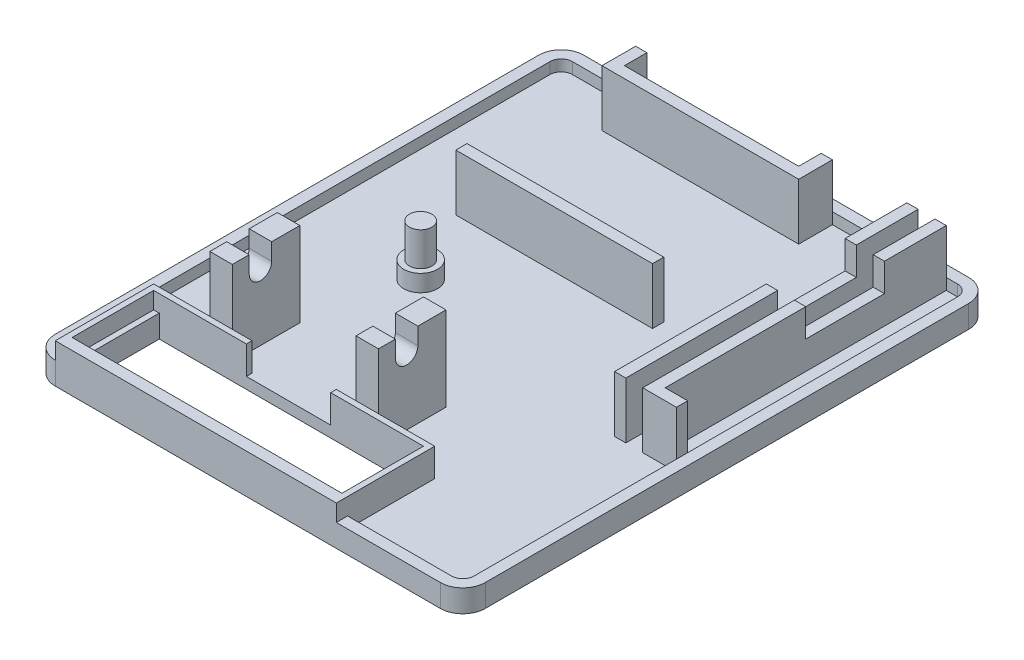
ISO-10303-21;
HEADER;
FILE_DESCRIPTION(('STEP AP214'),'2;1');
FILE_NAME('part.step','',(''),(''),'','','');
FILE_SCHEMA(('AUTOMOTIVE_DESIGN { 1 0 10303 214 1 1 1 1 }'));
ENDSEC;
DATA;
#1=APPLICATION_CONTEXT('core data for automotive mechanical design processes');
#2=APPLICATION_PROTOCOL_DEFINITION('international standard','automotive_design',2000,#1);
#3=PRODUCT_CONTEXT('',#1,'mechanical');
#4=PRODUCT('Part','Part','',(#3));
#5=PRODUCT_RELATED_PRODUCT_CATEGORY('part','',(#4));
#6=PRODUCT_DEFINITION_FORMATION('','',#4);
#7=PRODUCT_DEFINITION_CONTEXT('part definition',#1,'design');
#8=PRODUCT_DEFINITION('design','',#6,#7);
#9=PRODUCT_DEFINITION_SHAPE('','',#8);
#10=(LENGTH_UNIT() NAMED_UNIT(*) SI_UNIT(.MILLI.,.METRE.));
#11=(NAMED_UNIT(*) PLANE_ANGLE_UNIT() SI_UNIT($,.RADIAN.));
#12=(NAMED_UNIT(*) SI_UNIT($,.STERADIAN.) SOLID_ANGLE_UNIT());
#13=UNCERTAINTY_MEASURE_WITH_UNIT(LENGTH_MEASURE(1.E-05),#10,'distance_accuracy_value','');
#14=(GEOMETRIC_REPRESENTATION_CONTEXT(3) GLOBAL_UNCERTAINTY_ASSIGNED_CONTEXT((#13)) GLOBAL_UNIT_ASSIGNED_CONTEXT((#10,
#11,#12)) REPRESENTATION_CONTEXT('',''));
#15=CARTESIAN_POINT('',(0.,0.,0.));
#16=DIRECTION('',(0.,0.,1.));
#17=DIRECTION('',(1.,0.,0.));
#18=AXIS2_PLACEMENT_3D('',#15,#16,#17);
#19=CARTESIAN_POINT('',(0.,23.230124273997,0.));
#20=DIRECTION('',(0.,-1.,0.));
#21=DIRECTION('',(0.,0.,-1.));
#22=AXIS2_PLACEMENT_3D('',#19,#20,#21);
#23=PLANE('',#22);
#24=DIRECTION('',(0.,0.,-1.));
#25=VECTOR('',#24,1.);
#26=CARTESIAN_POINT('',(25.8217828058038,23.230124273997,87.3624482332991));
#27=LINE('',#26,#25);
#28=CARTESIAN_POINT('',(25.8217828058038,23.230124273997,87.3624482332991));
#29=VERTEX_POINT('',#28);
#30=CARTESIAN_POINT('',(25.8217828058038,23.230124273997,84.3624482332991));
#31=VERTEX_POINT('',#30);
#32=EDGE_CURVE('E654',#29,#31,#27,.T.);
#33=ORIENTED_EDGE('',*,*,#32,.T.);
#34=DIRECTION('',(1.,0.,0.));
#35=VECTOR('',#34,1.);
#36=CARTESIAN_POINT('',(-10.581341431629,23.230124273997,84.3624482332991));
#37=LINE('',#36,#35);
#38=CARTESIAN_POINT('',(21.8217828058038,23.230124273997,84.3624482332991));
#39=VERTEX_POINT('',#38);
#40=EDGE_CURVE('E595',#39,#31,#37,.T.);
#41=ORIENTED_EDGE('',*,*,#40,.F.);
#42=DIRECTION('',(0.,0.,1.));
#43=VECTOR('',#42,1.);
#44=CARTESIAN_POINT('',(21.8217828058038,23.230124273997,87.3624482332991));
#45=LINE('',#44,#43);
#46=CARTESIAN_POINT('',(21.8217828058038,23.230124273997,87.3624482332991));
#47=VERTEX_POINT('',#46);
#48=EDGE_CURVE('E652',#39,#47,#45,.T.);
#49=ORIENTED_EDGE('',*,*,#48,.T.);
#50=DIRECTION('',(1.,0.,0.));
#51=VECTOR('',#50,1.);
#52=CARTESIAN_POINT('',(21.8217828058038,23.230124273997,87.3624482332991));
#53=LINE('',#52,#51);
#54=EDGE_CURVE('E651',#47,#29,#53,.T.);
#55=ORIENTED_EDGE('',*,*,#54,.T.);
#56=EDGE_LOOP('',(#33,#41,#49,#55));
#57=FACE_BOUND('',#56,.T.);
#58=ADVANCED_FACE('F33',(#57),#23,.F.);
#59=CARTESIAN_POINT('',(0.,23.230124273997,0.));
#60=DIRECTION('',(0.,-1.,0.));
#61=DIRECTION('',(0.,0.,-1.));
#62=AXIS2_PLACEMENT_3D('',#59,#60,#61);
#63=PLANE('',#62);
#64=DIRECTION('',(0.,0.,-1.));
#65=VECTOR('',#64,1.);
#66=CARTESIAN_POINT('',(-0.178217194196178,23.230124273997,87.3624482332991));
#67=LINE('',#66,#65);
#68=CARTESIAN_POINT('',(-0.178217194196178,23.230124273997,87.3624482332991));
#69=VERTEX_POINT('',#68);
#70=CARTESIAN_POINT('',(-0.178217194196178,23.230124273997,84.3624482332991));
#71=VERTEX_POINT('',#70);
#72=EDGE_CURVE('E621',#69,#71,#67,.T.);
#73=ORIENTED_EDGE('',*,*,#72,.T.);
#74=CARTESIAN_POINT('',(-4.17821719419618,23.230124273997,84.3624482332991));
#75=VERTEX_POINT('',#74);
#76=EDGE_CURVE('E593',#75,#71,#37,.T.);
#77=ORIENTED_EDGE('',*,*,#76,.F.);
#78=DIRECTION('',(0.,0.,1.));
#79=VECTOR('',#78,1.);
#80=CARTESIAN_POINT('',(-4.17821719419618,23.230124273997,87.3624482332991));
#81=LINE('',#80,#79);
#82=CARTESIAN_POINT('',(-4.17821719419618,23.230124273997,87.3624482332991));
#83=VERTEX_POINT('',#82);
#84=EDGE_CURVE('E626',#75,#83,#81,.T.);
#85=ORIENTED_EDGE('',*,*,#84,.T.);
#86=DIRECTION('',(1.,0.,0.));
#87=VECTOR('',#86,1.);
#88=CARTESIAN_POINT('',(-0.178217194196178,23.230124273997,87.3624482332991));
#89=LINE('',#88,#87);
#90=EDGE_CURVE('E616',#83,#69,#89,.T.);
#91=ORIENTED_EDGE('',*,*,#90,.T.);
#92=EDGE_LOOP('',(#73,#77,#85,#91));
#93=FACE_BOUND('',#92,.T.);
#94=ADVANCED_FACE('F1291',(#93),#63,.F.);
#95=CARTESIAN_POINT('',(54.3217828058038,8.23012427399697,100.862448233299));
#96=DIRECTION('',(0.,-1.,0.));
#97=DIRECTION('',(0.,0.,-1.));
#98=AXIS2_PLACEMENT_3D('',#95,#96,#97);
#99=PLANE('',#98);
#100=CARTESIAN_POINT('',(3.82178280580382,8.23012427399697,57.8624482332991));
#101=DIRECTION('',(0.,-1.,0.));
#102=DIRECTION('',(0.,0.,-1.));
#103=AXIS2_PLACEMENT_3D('',#100,#101,#102);
#104=CIRCLE('',#103,3.);
#105=CARTESIAN_POINT('',(3.82178280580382,8.23012427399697,54.8624482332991));
#106=VERTEX_POINT('',#105);
#107=EDGE_CURVE('E11',#106,#106,#104,.F.);
#108=ORIENTED_EDGE('',*,*,#107,.F.);
#109=EDGE_LOOP('',(#108));
#110=FACE_BOUND('',#109,.T.);
#111=DIRECTION('',(0.,0.,1.));
#112=VECTOR('',#111,1.);
#113=CARTESIAN_POINT('',(32.0717828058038,8.23012427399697,42.8624482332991));
#114=LINE('',#113,#112);
#115=CARTESIAN_POINT('',(32.0717828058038,8.23012427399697,42.8624482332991));
#116=VERTEX_POINT('',#115);
#117=CARTESIAN_POINT('',(32.0717828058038,8.23012427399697,44.8624482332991));
#118=VERTEX_POINT('',#117);
#119=EDGE_CURVE('E1152',#116,#118,#114,.T.);
#120=ORIENTED_EDGE('',*,*,#119,.T.);
#121=DIRECTION('',(-1.,0.,0.));
#122=VECTOR('',#121,1.);
#123=CARTESIAN_POINT('',(-2.92821719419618,8.23012427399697,44.8624482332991));
#124=LINE('',#123,#122);
#125=CARTESIAN_POINT('',(-2.92821719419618,8.23012427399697,44.8624482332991));
#126=VERTEX_POINT('',#125);
#127=EDGE_CURVE('E1169',#118,#126,#124,.T.);
#128=ORIENTED_EDGE('',*,*,#127,.T.);
#129=DIRECTION('',(0.,0.,-1.));
#130=VECTOR('',#129,1.);
#131=CARTESIAN_POINT('',(-2.92821719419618,8.23012427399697,42.8624482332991));
#132=LINE('',#131,#130);
#133=CARTESIAN_POINT('',(-2.92821719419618,8.23012427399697,42.8624482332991));
#134=VERTEX_POINT('',#133);
#135=EDGE_CURVE('E1172',#126,#134,#132,.T.);
#136=ORIENTED_EDGE('',*,*,#135,.T.);
#137=DIRECTION('',(1.,0.,0.));
#138=VECTOR('',#137,1.);
#139=CARTESIAN_POINT('',(-2.92821719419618,8.23012427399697,42.8624482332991));
#140=LINE('',#139,#138);
#141=EDGE_CURVE('E1157',#134,#116,#140,.T.);
#142=ORIENTED_EDGE('',*,*,#141,.T.);
#143=EDGE_LOOP('',(#120,#128,#136,#142));
#144=FACE_BOUND('',#143,.T.);
#145=DIRECTION('',(0.,0.,-1.));
#146=VECTOR('',#145,1.);
#147=CARTESIAN_POINT('',(-0.178217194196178,8.23012427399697,87.3624482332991));
#148=LINE('',#147,#146);
#149=CARTESIAN_POINT('',(-0.178217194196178,8.23012427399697,87.3624482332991));
#150=VERTEX_POINT('',#149);
#151=CARTESIAN_POINT('',(-0.178217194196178,8.23012427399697,75.3624482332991));
#152=VERTEX_POINT('',#151);
#153=EDGE_CURVE('E615',#150,#152,#148,.T.);
#154=ORIENTED_EDGE('',*,*,#153,.F.);
#155=DIRECTION('',(-1.,0.,0.));
#156=VECTOR('',#155,1.);
#157=CARTESIAN_POINT('',(-14.1782171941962,8.23012427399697,87.3624482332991));
#158=LINE('',#157,#156);
#159=CARTESIAN_POINT('',(3.32178280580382,8.23012427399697,87.3624482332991));
#160=VERTEX_POINT('',#159);
#161=EDGE_CURVE('E790',#160,#150,#158,.T.);
#162=ORIENTED_EDGE('',*,*,#161,.F.);
#163=DIRECTION('',(0.,0.,-1.));
#164=VECTOR('',#163,1.);
#165=CARTESIAN_POINT('',(3.32178280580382,8.23012427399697,89.3624482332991));
#166=LINE('',#165,#164);
#167=CARTESIAN_POINT('',(3.32178280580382,8.23012427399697,88.3624482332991));
#168=VERTEX_POINT('',#167);
#169=EDGE_CURVE('E743',#168,#160,#166,.T.);
#170=ORIENTED_EDGE('',*,*,#169,.F.);
#171=DIRECTION('',(-1.,0.,0.));
#172=VECTOR('',#171,1.);
#173=CARTESIAN_POINT('',(-12.1782171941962,8.23012427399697,88.3624482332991));
#174=LINE('',#173,#172);
#175=CARTESIAN_POINT('',(18.3217828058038,8.23012427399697,88.3624482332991));
#176=VERTEX_POINT('',#175);
#177=EDGE_CURVE('E695',#176,#168,#174,.T.);
#178=ORIENTED_EDGE('',*,*,#177,.F.);
#179=DIRECTION('',(0.,0.,-1.));
#180=VECTOR('',#179,1.);
#181=CARTESIAN_POINT('',(18.3217828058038,8.23012427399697,89.3624482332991));
#182=LINE('',#181,#180);
#183=CARTESIAN_POINT('',(18.3217828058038,8.23012427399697,87.3624482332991));
#184=VERTEX_POINT('',#183);
#185=EDGE_CURVE('E742',#176,#184,#182,.T.);
#186=ORIENTED_EDGE('',*,*,#185,.T.);
#187=CARTESIAN_POINT('',(21.8217828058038,8.23012427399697,87.3624482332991));
#188=VERTEX_POINT('',#187);
#189=EDGE_CURVE('E789',#188,#184,#158,.T.);
#190=ORIENTED_EDGE('',*,*,#189,.F.);
#191=DIRECTION('',(0.,0.,1.));
#192=VECTOR('',#191,1.);
#193=CARTESIAN_POINT('',(21.8217828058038,8.23012427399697,87.3624482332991));
#194=LINE('',#193,#192);
#195=CARTESIAN_POINT('',(21.8217828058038,8.23012427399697,75.3624482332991));
#196=VERTEX_POINT('',#195);
#197=EDGE_CURVE('E647',#196,#188,#194,.T.);
#198=ORIENTED_EDGE('',*,*,#197,.F.);
#199=DIRECTION('',(-1.,0.,0.));
#200=VECTOR('',#199,1.);
#201=CARTESIAN_POINT('',(21.8217828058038,8.23012427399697,75.3624482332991));
#202=LINE('',#201,#200);
#203=CARTESIAN_POINT('',(25.8217828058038,8.23012427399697,75.3624482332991));
#204=VERTEX_POINT('',#203);
#205=EDGE_CURVE('E663',#204,#196,#202,.T.);
#206=ORIENTED_EDGE('',*,*,#205,.F.);
#207=DIRECTION('',(0.,0.,-1.));
#208=VECTOR('',#207,1.);
#209=CARTESIAN_POINT('',(25.8217828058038,8.23012427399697,87.3624482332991));
#210=LINE('',#209,#208);
#211=CARTESIAN_POINT('',(25.8217828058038,8.23012427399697,87.3624482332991));
#212=VERTEX_POINT('',#211);
#213=EDGE_CURVE('E661',#212,#204,#210,.T.);
#214=ORIENTED_EDGE('',*,*,#213,.F.);
#215=CARTESIAN_POINT('',(35.8217828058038,8.23012427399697,87.3624482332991));
#216=VERTEX_POINT('',#215);
#217=EDGE_CURVE('E785',#216,#212,#158,.T.);
#218=ORIENTED_EDGE('',*,*,#217,.F.);
#219=DIRECTION('',(0.,0.,-1.));
#220=VECTOR('',#219,1.);
#221=CARTESIAN_POINT('',(35.8217828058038,8.23012427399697,87.3624482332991));
#222=LINE('',#221,#220);
#223=CARTESIAN_POINT('',(35.8217828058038,8.23012427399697,102.862448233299));
#224=VERTEX_POINT('',#223);
#225=EDGE_CURVE('E782',#224,#216,#222,.T.);
#226=ORIENTED_EDGE('',*,*,#225,.F.);
#227=DIRECTION('',(-1.,0.,0.));
#228=VECTOR('',#227,1.);
#229=CARTESIAN_POINT('',(54.3217828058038,8.23012427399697,102.862448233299));
#230=LINE('',#229,#228);
#231=CARTESIAN_POINT('',(54.3217828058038,8.23012427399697,102.862448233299));
#232=VERTEX_POINT('',#231);
#233=EDGE_CURVE('E848',#232,#224,#230,.T.);
#234=ORIENTED_EDGE('',*,*,#233,.F.);
#235=CARTESIAN_POINT('',(54.3217828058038,8.23012427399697,100.862448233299));
#236=DIRECTION('',(0.,-1.,0.));
#237=DIRECTION('',(0.,0.,-1.));
#238=AXIS2_PLACEMENT_3D('',#235,#236,#237);
#239=CIRCLE('',#238,2.);
#240=CARTESIAN_POINT('',(56.3217828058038,8.23012427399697,100.862448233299));
#241=VERTEX_POINT('',#240);
#242=EDGE_CURVE('E845',#241,#232,#239,.T.);
#243=ORIENTED_EDGE('',*,*,#242,.F.);
#244=DIRECTION('',(0.,0.,1.));
#245=VECTOR('',#244,1.);
#246=CARTESIAN_POINT('',(56.3217828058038,8.23012427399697,14.8624482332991));
#247=LINE('',#246,#245);
#248=CARTESIAN_POINT('',(56.3217828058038,8.23012427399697,64.8624482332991));
#249=VERTEX_POINT('',#248);
#250=EDGE_CURVE('E841',#249,#241,#247,.T.);
#251=ORIENTED_EDGE('',*,*,#250,.F.);
#252=DIRECTION('',(-1.,0.,0.));
#253=VECTOR('',#252,1.);
#254=CARTESIAN_POINT('',(52.3217828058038,8.23012427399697,64.8624482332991));
#255=LINE('',#254,#253);
#256=CARTESIAN_POINT('',(50.3217828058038,8.23012427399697,64.8624482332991));
#257=VERTEX_POINT('',#256);
#258=EDGE_CURVE('E972',#249,#257,#255,.T.);
#259=ORIENTED_EDGE('',*,*,#258,.T.);
#260=DIRECTION('',(0.,0.,-1.));
#261=VECTOR('',#260,1.);
#262=CARTESIAN_POINT('',(50.3217828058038,8.23012427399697,12.8624482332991));
#263=LINE('',#262,#261);
#264=CARTESIAN_POINT('',(50.3217828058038,8.23012427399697,12.8624482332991));
#265=VERTEX_POINT('',#264);
#266=EDGE_CURVE('E950',#257,#265,#263,.T.);
#267=ORIENTED_EDGE('',*,*,#266,.T.);
#268=DIRECTION('',(1.,0.,0.));
#269=VECTOR('',#268,1.);
#270=CARTESIAN_POINT('',(54.3217828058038,8.23012427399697,12.8624482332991));
#271=LINE('',#270,#269);
#272=CARTESIAN_POINT('',(47.3217828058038,8.23012427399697,12.8624482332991));
#273=VERTEX_POINT('',#272);
#274=EDGE_CURVE('E2227',#273,#265,#271,.T.);
#275=ORIENTED_EDGE('',*,*,#274,.F.);
#276=DIRECTION('',(0.,0.,1.));
#277=VECTOR('',#276,1.);
#278=CARTESIAN_POINT('',(47.3217828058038,8.23012427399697,12.8624482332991));
#279=LINE('',#278,#277);
#280=CARTESIAN_POINT('',(47.3217828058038,8.23012427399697,64.8624482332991));
#281=VERTEX_POINT('',#280);
#282=EDGE_CURVE('E1041',#273,#281,#279,.T.);
#283=ORIENTED_EDGE('',*,*,#282,.T.);
#284=DIRECTION('',(-1.,0.,0.));
#285=VECTOR('',#284,1.);
#286=CARTESIAN_POINT('',(45.3217828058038,8.23012427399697,64.8624482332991));
#287=LINE('',#286,#285);
#288=CARTESIAN_POINT('',(45.3217828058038,8.23012427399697,64.8624482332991));
#289=VERTEX_POINT('',#288);
#290=EDGE_CURVE('E1044',#281,#289,#287,.T.);
#291=ORIENTED_EDGE('',*,*,#290,.T.);
#292=DIRECTION('',(0.,0.,-1.));
#293=VECTOR('',#292,1.);
#294=CARTESIAN_POINT('',(45.3217828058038,8.23012427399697,12.8624482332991));
#295=LINE('',#294,#293);
#296=CARTESIAN_POINT('',(45.3217828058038,8.23012427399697,12.8624482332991));
#297=VERTEX_POINT('',#296);
#298=EDGE_CURVE('E1023',#289,#297,#295,.T.);
#299=ORIENTED_EDGE('',*,*,#298,.T.);
#300=CARTESIAN_POINT('',(32.0717828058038,8.23012427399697,12.8624482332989));
#301=VERTEX_POINT('',#300);
#302=EDGE_CURVE('E2232',#301,#297,#271,.T.);
#303=ORIENTED_EDGE('',*,*,#302,.F.);
#304=DIRECTION('',(0.,0.,1.));
#305=VECTOR('',#304,1.);
#306=CARTESIAN_POINT('',(32.0717828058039,8.23012427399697,18.8624482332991));
#307=LINE('',#306,#305);
#308=CARTESIAN_POINT('',(32.0717828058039,8.23012427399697,18.8624482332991));
#309=VERTEX_POINT('',#308);
#310=EDGE_CURVE('E1092',#301,#309,#307,.T.);
#311=ORIENTED_EDGE('',*,*,#310,.T.);
#312=DIRECTION('',(-1.,0.,0.));
#313=VECTOR('',#312,1.);
#314=CARTESIAN_POINT('',(-2.92821719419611,8.23012427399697,18.8624482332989));
#315=LINE('',#314,#313);
#316=CARTESIAN_POINT('',(-2.92821719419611,8.23012427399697,18.8624482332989));
#317=VERTEX_POINT('',#316);
#318=EDGE_CURVE('E1095',#309,#317,#315,.T.);
#319=ORIENTED_EDGE('',*,*,#318,.T.);
#320=DIRECTION('',(0.,0.,-1.));
#321=VECTOR('',#320,1.);
#322=CARTESIAN_POINT('',(-2.92821719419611,8.23012427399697,18.8624482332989));
#323=LINE('',#322,#321);
#324=CARTESIAN_POINT('',(-2.92821719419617,8.23012427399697,12.8624482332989));
#325=VERTEX_POINT('',#324);
#326=EDGE_CURVE('E1063',#317,#325,#323,.T.);
#327=ORIENTED_EDGE('',*,*,#326,.T.);
#328=CARTESIAN_POINT('',(-14.1782171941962,8.23012427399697,12.862448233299));
#329=VERTEX_POINT('',#328);
#330=EDGE_CURVE('E813',#329,#325,#271,.T.);
#331=ORIENTED_EDGE('',*,*,#330,.F.);
#332=CARTESIAN_POINT('',(-14.1782171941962,8.23012427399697,14.862448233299));
#333=DIRECTION('',(0.,-1.,0.));
#334=DIRECTION('',(0.,0.,-1.));
#335=AXIS2_PLACEMENT_3D('',#332,#333,#334);
#336=CIRCLE('',#335,2.);
#337=CARTESIAN_POINT('',(-16.1782171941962,8.23012427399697,14.8624482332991));
#338=VERTEX_POINT('',#337);
#339=EDGE_CURVE('E857',#338,#329,#336,.T.);
#340=ORIENTED_EDGE('',*,*,#339,.F.);
#341=DIRECTION('',(0.,0.,-1.));
#342=VECTOR('',#341,1.);
#343=CARTESIAN_POINT('',(-16.1782171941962,8.23012427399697,14.8624482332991));
#344=LINE('',#343,#342);
#345=CARTESIAN_POINT('',(-16.1782171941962,8.23012427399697,100.862448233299));
#346=VERTEX_POINT('',#345);
#347=EDGE_CURVE('E854',#346,#338,#344,.T.);
#348=ORIENTED_EDGE('',*,*,#347,.F.);
#349=CARTESIAN_POINT('',(-14.1782171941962,8.23012427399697,100.862448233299));
#350=DIRECTION('',(0.,-1.,0.));
#351=DIRECTION('',(0.,0.,-1.));
#352=AXIS2_PLACEMENT_3D('',#349,#350,#351);
#353=CIRCLE('',#352,2.);
#354=CARTESIAN_POINT('',(-14.1782171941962,8.23012427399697,102.862448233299));
#355=VERTEX_POINT('',#354);
#356=EDGE_CURVE('E851',#355,#346,#353,.T.);
#357=ORIENTED_EDGE('',*,*,#356,.F.);
#358=DIRECTION('',(0.,0.,1.));
#359=VECTOR('',#358,1.);
#360=CARTESIAN_POINT('',(-14.1782171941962,8.23012427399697,87.3624482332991));
#361=LINE('',#360,#359);
#362=CARTESIAN_POINT('',(-14.1782171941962,8.23012427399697,87.3624482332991));
#363=VERTEX_POINT('',#362);
#364=EDGE_CURVE('E778',#363,#355,#361,.T.);
#365=ORIENTED_EDGE('',*,*,#364,.F.);
#366=CARTESIAN_POINT('',(-4.17821719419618,8.23012427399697,87.3624482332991));
#367=VERTEX_POINT('',#366);
#368=EDGE_CURVE('E784',#367,#363,#158,.T.);
#369=ORIENTED_EDGE('',*,*,#368,.F.);
#370=DIRECTION('',(0.,0.,1.));
#371=VECTOR('',#370,1.);
#372=CARTESIAN_POINT('',(-4.17821719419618,8.23012427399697,87.3624482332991));
#373=LINE('',#372,#371);
#374=CARTESIAN_POINT('',(-4.17821719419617,8.23012427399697,75.3624482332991));
#375=VERTEX_POINT('',#374);
#376=EDGE_CURVE('E620',#375,#367,#373,.T.);
#377=ORIENTED_EDGE('',*,*,#376,.F.);
#378=DIRECTION('',(-1.,0.,0.));
#379=VECTOR('',#378,1.);
#380=CARTESIAN_POINT('',(-0.178217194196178,8.23012427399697,75.3624482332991));
#381=LINE('',#380,#379);
#382=EDGE_CURVE('E632',#152,#375,#381,.T.);
#383=ORIENTED_EDGE('',*,*,#382,.F.);
#384=EDGE_LOOP('',(#154,#162,#170,#178,#186,#190,#198,#206,#214,#218,#226,#234,#243,#251,#259,
#267,#275,#283,#291,#299,#303,#311,#319,#327,#331,#340,#348,#357,#365,#369,#377,#383));
#385=FACE_BOUND('',#384,.T.);
#386=ADVANCED_FACE('F1246',(#110,#144,#385),#99,.F.);
#387=CARTESIAN_POINT('',(-14.1782171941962,8.23012427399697,87.3624482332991));
#388=DIRECTION('',(0.,0.,-1.));
#389=DIRECTION('',(-1.,0.,0.));
#390=AXIS2_PLACEMENT_3D('',#387,#388,#389);
#391=PLANE('',#390);
#392=ORIENTED_EDGE('',*,*,#161,.T.);
#393=DIRECTION('',(0.,-1.,0.));
#394=VECTOR('',#393,1.);
#395=CARTESIAN_POINT('',(-0.178217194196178,23.230124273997,87.3624482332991));
#396=LINE('',#395,#394);
#397=CARTESIAN_POINT('',(-0.178217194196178,13.230124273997,87.3624482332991));
#398=VERTEX_POINT('',#397);
#399=EDGE_CURVE('E643',#398,#150,#396,.T.);
#400=ORIENTED_EDGE('',*,*,#399,.F.);
#401=DIRECTION('',(-1.,0.,0.));
#402=VECTOR('',#401,1.);
#403=CARTESIAN_POINT('',(-14.1782171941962,13.230124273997,87.3624482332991));
#404=LINE('',#403,#402);
#405=CARTESIAN_POINT('',(3.32178280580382,13.230124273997,87.3624482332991));
#406=VERTEX_POINT('',#405);
#407=EDGE_CURVE('E780',#406,#398,#404,.T.);
#408=ORIENTED_EDGE('',*,*,#407,.F.);
#409=DIRECTION('',(0.,1.,0.));
#410=VECTOR('',#409,1.);
#411=CARTESIAN_POINT('',(3.32178280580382,13.230124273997,87.3624482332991));
#412=LINE('',#411,#410);
#413=EDGE_CURVE('E737',#160,#406,#412,.T.);
#414=ORIENTED_EDGE('',*,*,#413,.F.);
#415=EDGE_LOOP('',(#392,#400,#408,#414));
#416=FACE_BOUND('',#415,.T.);
#417=ADVANCED_FACE('F1259',(#416),#391,.T.);
#418=CARTESIAN_POINT('',(-4.17821719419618,13.230124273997,87.3624482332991));
#419=VERTEX_POINT('',#418);
#420=CARTESIAN_POINT('',(-14.1782171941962,13.230124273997,87.3624482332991));
#421=VERTEX_POINT('',#420);
#422=EDGE_CURVE('E774',#419,#421,#404,.T.);
#423=ORIENTED_EDGE('',*,*,#422,.F.);
#424=DIRECTION('',(0.,-1.,0.));
#425=VECTOR('',#424,1.);
#426=CARTESIAN_POINT('',(-4.17821719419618,23.230124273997,87.3624482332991));
#427=LINE('',#426,#425);
#428=EDGE_CURVE('E630',#419,#367,#427,.T.);
#429=ORIENTED_EDGE('',*,*,#428,.T.);
#430=ORIENTED_EDGE('',*,*,#368,.T.);
#431=DIRECTION('',(0.,1.,0.));
#432=VECTOR('',#431,1.);
#433=CARTESIAN_POINT('',(-14.1782171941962,8.23012427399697,87.3624482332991));
#434=LINE('',#433,#432);
#435=EDGE_CURVE('E791',#363,#421,#434,.T.);
#436=ORIENTED_EDGE('',*,*,#435,.T.);
#437=EDGE_LOOP('',(#423,#429,#430,#436));
#438=FACE_BOUND('',#437,.T.);
#439=ADVANCED_FACE('F1361',(#438),#391,.T.);
#440=CARTESIAN_POINT('',(21.8217828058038,13.230124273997,87.3624482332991));
#441=VERTEX_POINT('',#440);
#442=CARTESIAN_POINT('',(18.3217828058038,13.230124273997,87.3624482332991));
#443=VERTEX_POINT('',#442);
#444=EDGE_CURVE('E1234',#441,#443,#404,.T.);
#445=ORIENTED_EDGE('',*,*,#444,.F.);
#446=DIRECTION('',(0.,-1.,0.));
#447=VECTOR('',#446,1.);
#448=CARTESIAN_POINT('',(21.8217828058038,23.230124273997,87.3624482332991));
#449=LINE('',#448,#447);
#450=EDGE_CURVE('E674',#441,#188,#449,.T.);
#451=ORIENTED_EDGE('',*,*,#450,.T.);
#452=ORIENTED_EDGE('',*,*,#189,.T.);
#453=DIRECTION('',(0.,-1.,0.));
#454=VECTOR('',#453,1.);
#455=CARTESIAN_POINT('',(18.3217828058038,13.230124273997,87.3624482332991));
#456=LINE('',#455,#454);
#457=EDGE_CURVE('E739',#443,#184,#456,.T.);
#458=ORIENTED_EDGE('',*,*,#457,.F.);
#459=EDGE_LOOP('',(#445,#451,#452,#458));
#460=FACE_BOUND('',#459,.T.);
#461=ADVANCED_FACE('F1239',(#460),#391,.T.);
#462=ORIENTED_EDGE('',*,*,#217,.T.);
#463=DIRECTION('',(0.,-1.,0.));
#464=VECTOR('',#463,1.);
#465=CARTESIAN_POINT('',(25.8217828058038,23.230124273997,87.3624482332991));
#466=LINE('',#465,#464);
#467=CARTESIAN_POINT('',(25.8217828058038,13.230124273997,87.3624482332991));
#468=VERTEX_POINT('',#467);
#469=EDGE_CURVE('E670',#468,#212,#466,.T.);
#470=ORIENTED_EDGE('',*,*,#469,.F.);
#471=CARTESIAN_POINT('',(35.8217828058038,13.230124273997,87.3624482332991));
#472=VERTEX_POINT('',#471);
#473=EDGE_CURVE('E775',#472,#468,#404,.T.);
#474=ORIENTED_EDGE('',*,*,#473,.F.);
#475=DIRECTION('',(0.,1.,0.));
#476=VECTOR('',#475,1.);
#477=CARTESIAN_POINT('',(35.8217828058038,8.23012427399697,87.3624482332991));
#478=LINE('',#477,#476);
#479=EDGE_CURVE('E795',#216,#472,#478,.T.);
#480=ORIENTED_EDGE('',*,*,#479,.F.);
#481=EDGE_LOOP('',(#462,#470,#474,#480));
#482=FACE_BOUND('',#481,.T.);
#483=ADVANCED_FACE('F1271',(#482),#391,.T.);
#484=CARTESIAN_POINT('',(-13.1782171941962,8.23012427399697,88.3624482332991));
#485=DIRECTION('',(0.,0.,-1.));
#486=DIRECTION('',(-1.,0.,0.));
#487=AXIS2_PLACEMENT_3D('',#484,#485,#486);
#488=PLANE('',#487);
#489=DIRECTION('',(0.,-1.,0.));
#490=VECTOR('',#489,1.);
#491=CARTESIAN_POINT('',(33.8217828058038,8.23012427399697,88.3624482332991));
#492=LINE('',#491,#490);
#493=CARTESIAN_POINT('',(33.8217828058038,10.230124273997,88.3624482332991));
#494=VERTEX_POINT('',#493);
#495=CARTESIAN_POINT('',(33.8217828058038,6.23012427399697,88.3624482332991));
#496=VERTEX_POINT('',#495);
#497=EDGE_CURVE('E759',#494,#496,#492,.T.);
#498=ORIENTED_EDGE('',*,*,#497,.F.);
#499=DIRECTION('',(-1.,0.,0.));
#500=VECTOR('',#499,1.);
#501=CARTESIAN_POINT('',(-13.1782171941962,10.230124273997,88.3624482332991));
#502=LINE('',#501,#500);
#503=CARTESIAN_POINT('',(34.8217828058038,10.230124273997,88.3624482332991));
#504=VERTEX_POINT('',#503);
#505=EDGE_CURVE('E718',#504,#494,#502,.T.);
#506=ORIENTED_EDGE('',*,*,#505,.F.);
#507=DIRECTION('',(0.,1.,0.));
#508=VECTOR('',#507,1.);
#509=CARTESIAN_POINT('',(34.8217828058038,-39.9121732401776,88.3624482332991));
#510=LINE('',#509,#508);
#511=CARTESIAN_POINT('',(34.8217828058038,13.230124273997,88.3624482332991));
#512=VERTEX_POINT('',#511);
#513=EDGE_CURVE('E724',#504,#512,#510,.T.);
#514=ORIENTED_EDGE('',*,*,#513,.T.);
#515=DIRECTION('',(-1.,0.,0.));
#516=VECTOR('',#515,1.);
#517=CARTESIAN_POINT('',(-13.1782171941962,13.230124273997,88.3624482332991));
#518=LINE('',#517,#516);
#519=CARTESIAN_POINT('',(18.3217828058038,13.230124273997,88.3624482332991));
#520=VERTEX_POINT('',#519);
#521=EDGE_CURVE('E762',#512,#520,#518,.T.);
#522=ORIENTED_EDGE('',*,*,#521,.T.);
#523=DIRECTION('',(0.,-1.,0.));
#524=VECTOR('',#523,1.);
#525=CARTESIAN_POINT('',(18.3217828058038,8.23012427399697,88.3624482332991));
#526=LINE('',#525,#524);
#527=EDGE_CURVE('E745',#520,#176,#526,.T.);
#528=ORIENTED_EDGE('',*,*,#527,.T.);
#529=ORIENTED_EDGE('',*,*,#177,.T.);
#530=DIRECTION('',(0.,1.,0.));
#531=VECTOR('',#530,1.);
#532=CARTESIAN_POINT('',(3.32178280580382,8.23012427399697,88.3624482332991));
#533=LINE('',#532,#531);
#534=CARTESIAN_POINT('',(3.32178280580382,13.230124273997,88.3624482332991));
#535=VERTEX_POINT('',#534);
#536=EDGE_CURVE('E750',#168,#535,#533,.T.);
#537=ORIENTED_EDGE('',*,*,#536,.T.);
#538=CARTESIAN_POINT('',(-13.1782171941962,13.230124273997,88.3624482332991));
#539=VERTEX_POINT('',#538);
#540=EDGE_CURVE('E761',#535,#539,#518,.T.);
#541=ORIENTED_EDGE('',*,*,#540,.T.);
#542=DIRECTION('',(0.,1.,0.));
#543=VECTOR('',#542,1.);
#544=CARTESIAN_POINT('',(-13.1782171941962,-39.9121732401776,88.3624482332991));
#545=LINE('',#544,#543);
#546=CARTESIAN_POINT('',(-13.1782171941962,10.230124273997,88.3624482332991));
#547=VERTEX_POINT('',#546);
#548=EDGE_CURVE('E717',#547,#539,#545,.T.);
#549=ORIENTED_EDGE('',*,*,#548,.F.);
#550=CARTESIAN_POINT('',(-12.1782171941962,10.230124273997,88.3624482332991));
#551=VERTEX_POINT('',#550);
#552=EDGE_CURVE('E720',#551,#547,#502,.T.);
#553=ORIENTED_EDGE('',*,*,#552,.F.);
#554=DIRECTION('',(0.,1.,0.));
#555=VECTOR('',#554,1.);
#556=CARTESIAN_POINT('',(-12.1782171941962,8.23012427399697,88.3624482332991));
#557=LINE('',#556,#555);
#558=CARTESIAN_POINT('',(-12.1782171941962,6.23012427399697,88.3624482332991));
#559=VERTEX_POINT('',#558);
#560=EDGE_CURVE('E756',#559,#551,#557,.T.);
#561=ORIENTED_EDGE('',*,*,#560,.F.);
#562=DIRECTION('',(-1.,0.,0.));
#563=VECTOR('',#562,1.);
#564=CARTESIAN_POINT('',(-12.1782171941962,6.23012427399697,88.3624482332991));
#565=LINE('',#564,#563);
#566=EDGE_CURVE('E689',#496,#559,#565,.T.);
#567=ORIENTED_EDGE('',*,*,#566,.F.);
#568=EDGE_LOOP('',(#498,#506,#514,#522,#528,#529,#537,#541,#549,#553,#561,#567));
#569=FACE_BOUND('',#568,.T.);
#570=ADVANCED_FACE('F1213',(#569),#488,.F.);
#571=CARTESIAN_POINT('',(-0.928217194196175,8.23012427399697,12.8624482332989));
#572=VERTEX_POINT('',#571);
#573=CARTESIAN_POINT('',(30.0717828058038,8.23012427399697,12.8624482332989));
#574=VERTEX_POINT('',#573);
#575=EDGE_CURVE('E863',#572,#574,#271,.T.);
#576=ORIENTED_EDGE('',*,*,#575,.F.);
#577=DIRECTION('',(0.,0.,1.));
#578=VECTOR('',#577,1.);
#579=CARTESIAN_POINT('',(-0.928217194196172,8.23012427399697,12.8624482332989));
#580=LINE('',#579,#578);
#581=CARTESIAN_POINT('',(-0.928217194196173,8.23012427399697,16.8624482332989));
#582=VERTEX_POINT('',#581);
#583=EDGE_CURVE('E1058',#572,#582,#580,.T.);
#584=ORIENTED_EDGE('',*,*,#583,.T.);
#585=DIRECTION('',(1.,0.,0.));
#586=VECTOR('',#585,1.);
#587=CARTESIAN_POINT('',(-0.928217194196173,8.23012427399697,16.8624482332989));
#588=LINE('',#587,#586);
#589=CARTESIAN_POINT('',(30.0717828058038,8.23012427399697,16.8624482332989));
#590=VERTEX_POINT('',#589);
#591=EDGE_CURVE('E1086',#582,#590,#588,.T.);
#592=ORIENTED_EDGE('',*,*,#591,.T.);
#593=DIRECTION('',(0.,0.,-1.));
#594=VECTOR('',#593,1.);
#595=CARTESIAN_POINT('',(30.0717828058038,8.23012427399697,12.8624482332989));
#596=LINE('',#595,#594);
#597=EDGE_CURVE('E1089',#590,#574,#596,.T.);
#598=ORIENTED_EDGE('',*,*,#597,.T.);
#599=EDGE_LOOP('',(#576,#584,#592,#598));
#600=FACE_BOUND('',#599,.T.);
#601=ADVANCED_FACE('F1358',(#600),#99,.F.);
#602=CARTESIAN_POINT('',(52.3217828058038,8.23012427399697,12.8624482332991));
#603=VERTEX_POINT('',#602);
#604=CARTESIAN_POINT('',(54.3217828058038,8.23012427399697,12.8624482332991));
#605=VERTEX_POINT('',#604);
#606=EDGE_CURVE('E860',#603,#605,#271,.T.);
#607=ORIENTED_EDGE('',*,*,#606,.F.);
#608=DIRECTION('',(0.,0.,1.));
#609=VECTOR('',#608,1.);
#610=CARTESIAN_POINT('',(52.3217828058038,8.23012427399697,12.8624482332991));
#611=LINE('',#610,#609);
#612=CARTESIAN_POINT('',(52.3217828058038,8.23012427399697,62.8624482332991));
#613=VERTEX_POINT('',#612);
#614=EDGE_CURVE('E945',#603,#613,#611,.T.);
#615=ORIENTED_EDGE('',*,*,#614,.T.);
#616=DIRECTION('',(1.,0.,0.));
#617=VECTOR('',#616,1.);
#618=CARTESIAN_POINT('',(52.3217828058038,8.23012427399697,62.8624482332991));
#619=LINE('',#618,#617);
#620=CARTESIAN_POINT('',(56.3217828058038,8.23012427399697,62.8624482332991));
#621=VERTEX_POINT('',#620);
#622=EDGE_CURVE('E969',#613,#621,#619,.T.);
#623=ORIENTED_EDGE('',*,*,#622,.T.);
#624=CARTESIAN_POINT('',(56.3217828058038,8.23012427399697,14.8624482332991));
#625=VERTEX_POINT('',#624);
#626=EDGE_CURVE('E842',#625,#621,#247,.T.);
#627=ORIENTED_EDGE('',*,*,#626,.F.);
#628=CARTESIAN_POINT('',(54.3217828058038,8.23012427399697,14.8624482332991));
#629=DIRECTION('',(0.,-1.,0.));
#630=DIRECTION('',(0.,0.,-1.));
#631=AXIS2_PLACEMENT_3D('',#628,#629,#630);
#632=CIRCLE('',#631,2.);
#633=EDGE_CURVE('E808',#605,#625,#632,.T.);
#634=ORIENTED_EDGE('',*,*,#633,.F.);
#635=EDGE_LOOP('',(#607,#615,#623,#627,#634));
#636=FACE_BOUND('',#635,.T.);
#637=ADVANCED_FACE('F1506',(#636),#99,.F.);
#638=CARTESIAN_POINT('',(32.0717828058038,18.230124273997,12.8624482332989));
#639=DIRECTION('',(0.,0.,-1.));
#640=DIRECTION('',(-1.,0.,0.));
#641=AXIS2_PLACEMENT_3D('',#638,#639,#640);
#642=PLANE('',#641);
#643=DIRECTION('',(0.,-1.,0.));
#644=VECTOR('',#643,1.);
#645=CARTESIAN_POINT('',(32.0717828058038,18.230124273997,12.8624482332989));
#646=LINE('',#645,#644);
#647=CARTESIAN_POINT('',(32.0717828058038,18.230124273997,12.8624482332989));
#648=VERTEX_POINT('',#647);
#649=CARTESIAN_POINT('',(32.0717828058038,10.230124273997,12.8624482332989));
#650=VERTEX_POINT('',#649);
#651=EDGE_CURVE('E1105',#648,#650,#646,.T.);
#652=ORIENTED_EDGE('',*,*,#651,.T.);
#653=DIRECTION('',(1.,0.,0.));
#654=VECTOR('',#653,1.);
#655=CARTESIAN_POINT('',(54.3217828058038,10.230124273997,12.8624482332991));
#656=LINE('',#655,#654);
#657=CARTESIAN_POINT('',(30.0717828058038,10.230124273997,12.8624482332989));
#658=VERTEX_POINT('',#657);
#659=EDGE_CURVE('E2249',#658,#650,#656,.T.);
#660=ORIENTED_EDGE('',*,*,#659,.F.);
#661=DIRECTION('',(0.,-1.,0.));
#662=VECTOR('',#661,1.);
#663=CARTESIAN_POINT('',(30.0717828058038,18.230124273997,12.8624482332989));
#664=LINE('',#663,#662);
#665=CARTESIAN_POINT('',(30.0717828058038,18.230124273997,12.8624482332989));
#666=VERTEX_POINT('',#665);
#667=EDGE_CURVE('E1108',#666,#658,#664,.T.);
#668=ORIENTED_EDGE('',*,*,#667,.F.);
#669=DIRECTION('',(1.,0.,0.));
#670=VECTOR('',#669,1.);
#671=CARTESIAN_POINT('',(32.0717828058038,18.230124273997,12.8624482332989));
#672=LINE('',#671,#670);
#673=EDGE_CURVE('E1075',#666,#648,#672,.T.);
#674=ORIENTED_EDGE('',*,*,#673,.T.);
#675=EDGE_LOOP('',(#652,#660,#668,#674));
#676=FACE_BOUND('',#675,.T.);
#677=ADVANCED_FACE('F1503',(#676),#642,.T.);
#678=CARTESIAN_POINT('',(-2.92821719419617,18.230124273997,12.8624482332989));
#679=DIRECTION('',(0.,0.,-1.));
#680=DIRECTION('',(-1.,0.,0.));
#681=AXIS2_PLACEMENT_3D('',#678,#679,#680);
#682=PLANE('',#681);
#683=DIRECTION('',(0.,-1.,0.));
#684=VECTOR('',#683,1.);
#685=CARTESIAN_POINT('',(-0.928217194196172,18.230124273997,12.8624482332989));
#686=LINE('',#685,#684);
#687=CARTESIAN_POINT('',(-0.928217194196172,18.230124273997,12.8624482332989));
#688=VERTEX_POINT('',#687);
#689=CARTESIAN_POINT('',(-0.928217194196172,10.230124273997,12.8624482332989));
#690=VERTEX_POINT('',#689);
#691=EDGE_CURVE('E1115',#688,#690,#686,.T.);
#692=ORIENTED_EDGE('',*,*,#691,.T.);
#693=CARTESIAN_POINT('',(-2.92821719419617,10.230124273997,12.8624482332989));
#694=VERTEX_POINT('',#693);
#695=EDGE_CURVE('E838',#694,#690,#656,.T.);
#696=ORIENTED_EDGE('',*,*,#695,.F.);
#697=DIRECTION('',(0.,-1.,0.));
#698=VECTOR('',#697,1.);
#699=CARTESIAN_POINT('',(-2.92821719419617,18.230124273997,12.8624482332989));
#700=LINE('',#699,#698);
#701=CARTESIAN_POINT('',(-2.92821719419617,18.230124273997,12.8624482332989));
#702=VERTEX_POINT('',#701);
#703=EDGE_CURVE('E1083',#702,#694,#700,.T.);
#704=ORIENTED_EDGE('',*,*,#703,.F.);
#705=DIRECTION('',(1.,0.,0.));
#706=VECTOR('',#705,1.);
#707=CARTESIAN_POINT('',(-2.92821719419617,18.230124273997,12.8624482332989));
#708=LINE('',#707,#706);
#709=EDGE_CURVE('E1062',#702,#688,#708,.T.);
#710=ORIENTED_EDGE('',*,*,#709,.T.);
#711=EDGE_LOOP('',(#692,#696,#704,#710));
#712=FACE_BOUND('',#711,.T.);
#713=ADVANCED_FACE('F1479',(#712),#682,.T.);
#714=CARTESIAN_POINT('',(45.3217828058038,18.230124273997,12.8624482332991));
#715=DIRECTION('',(0.,0.,-1.));
#716=DIRECTION('',(-1.,0.,0.));
#717=AXIS2_PLACEMENT_3D('',#714,#715,#716);
#718=PLANE('',#717);
#719=DIRECTION('',(0.,-1.,0.));
#720=VECTOR('',#719,1.);
#721=CARTESIAN_POINT('',(47.3217828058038,18.230124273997,12.8624482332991));
#722=LINE('',#721,#720);
#723=CARTESIAN_POINT('',(47.3217828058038,18.230124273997,12.8624482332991));
#724=VERTEX_POINT('',#723);
#725=CARTESIAN_POINT('',(47.3217828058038,10.230124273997,12.8624482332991));
#726=VERTEX_POINT('',#725);
#727=EDGE_CURVE('E1052',#724,#726,#722,.T.);
#728=ORIENTED_EDGE('',*,*,#727,.T.);
#729=CARTESIAN_POINT('',(45.3217828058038,10.230124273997,12.8624482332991));
#730=VERTEX_POINT('',#729);
#731=EDGE_CURVE('E2245',#730,#726,#656,.T.);
#732=ORIENTED_EDGE('',*,*,#731,.F.);
#733=DIRECTION('',(0.,-1.,0.));
#734=VECTOR('',#733,1.);
#735=CARTESIAN_POINT('',(45.3217828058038,18.230124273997,12.8624482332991));
#736=LINE('',#735,#734);
#737=CARTESIAN_POINT('',(45.3217828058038,18.230124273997,12.8624482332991));
#738=VERTEX_POINT('',#737);
#739=EDGE_CURVE('E1038',#738,#730,#736,.T.);
#740=ORIENTED_EDGE('',*,*,#739,.F.);
#741=DIRECTION('',(1.,0.,0.));
#742=VECTOR('',#741,1.);
#743=CARTESIAN_POINT('',(45.3217828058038,18.230124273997,12.8624482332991));
#744=LINE('',#743,#742);
#745=EDGE_CURVE('E1027',#738,#724,#744,.T.);
#746=ORIENTED_EDGE('',*,*,#745,.T.);
#747=EDGE_LOOP('',(#728,#732,#740,#746));
#748=FACE_BOUND('',#747,.T.);
#749=ADVANCED_FACE('F1449',(#748),#718,.T.);
#750=CARTESIAN_POINT('',(52.3217828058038,18.230124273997,12.8624482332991));
#751=DIRECTION('',(0.,0.,-1.));
#752=DIRECTION('',(-1.,0.,0.));
#753=AXIS2_PLACEMENT_3D('',#750,#751,#752);
#754=PLANE('',#753);
#755=DIRECTION('',(0.,-1.,0.));
#756=VECTOR('',#755,1.);
#757=CARTESIAN_POINT('',(52.3217828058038,18.230124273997,12.8624482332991));
#758=LINE('',#757,#756);
#759=CARTESIAN_POINT('',(52.3217828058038,18.230124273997,12.8624482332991));
#760=VERTEX_POINT('',#759);
#761=CARTESIAN_POINT('',(52.3217828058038,10.230124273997,12.8624482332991));
#762=VERTEX_POINT('',#761);
#763=EDGE_CURVE('E993',#760,#762,#758,.T.);
#764=ORIENTED_EDGE('',*,*,#763,.T.);
#765=CARTESIAN_POINT('',(50.3217828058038,10.230124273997,12.8624482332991));
#766=VERTEX_POINT('',#765);
#767=EDGE_CURVE('E2243',#766,#762,#656,.T.);
#768=ORIENTED_EDGE('',*,*,#767,.F.);
#769=DIRECTION('',(0.,-1.,0.));
#770=VECTOR('',#769,1.);
#771=CARTESIAN_POINT('',(50.3217828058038,18.230124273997,12.8624482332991));
#772=LINE('',#771,#770);
#773=CARTESIAN_POINT('',(50.3217828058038,18.230124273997,12.8624482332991));
#774=VERTEX_POINT('',#773);
#775=EDGE_CURVE('E977',#774,#766,#772,.T.);
#776=ORIENTED_EDGE('',*,*,#775,.F.);
#777=DIRECTION('',(1.,0.,0.));
#778=VECTOR('',#777,1.);
#779=CARTESIAN_POINT('',(52.3217828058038,18.230124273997,12.8624482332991));
#780=LINE('',#779,#778);
#781=EDGE_CURVE('E946',#774,#760,#780,.T.);
#782=ORIENTED_EDGE('',*,*,#781,.T.);
#783=EDGE_LOOP('',(#764,#768,#776,#782));
#784=FACE_BOUND('',#783,.T.);
#785=ADVANCED_FACE('F1439',(#784),#754,.T.);
#786=CARTESIAN_POINT('',(56.3217828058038,18.230124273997,64.8624482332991));
#787=DIRECTION('',(1.,0.,0.));
#788=DIRECTION('',(0.,0.,-1.));
#789=AXIS2_PLACEMENT_3D('',#786,#787,#788);
#790=PLANE('',#789);
#791=DIRECTION('',(0.,-1.,0.));
#792=VECTOR('',#791,1.);
#793=CARTESIAN_POINT('',(56.3217828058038,18.230124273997,64.8624482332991));
#794=LINE('',#793,#792);
#795=CARTESIAN_POINT('',(56.3217828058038,18.230124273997,64.8624482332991));
#796=VERTEX_POINT('',#795);
#797=CARTESIAN_POINT('',(56.3217828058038,10.230124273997,64.8624482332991));
#798=VERTEX_POINT('',#797);
#799=EDGE_CURVE('E983',#796,#798,#794,.T.);
#800=ORIENTED_EDGE('',*,*,#799,.T.);
#801=DIRECTION('',(0.,0.,1.));
#802=VECTOR('',#801,1.);
#803=CARTESIAN_POINT('',(56.3217828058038,10.230124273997,14.8624482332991));
#804=LINE('',#803,#802);
#805=CARTESIAN_POINT('',(56.3217828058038,10.230124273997,62.8624482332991));
#806=VERTEX_POINT('',#805);
#807=EDGE_CURVE('E818',#806,#798,#804,.T.);
#808=ORIENTED_EDGE('',*,*,#807,.F.);
#809=DIRECTION('',(0.,-1.,0.));
#810=VECTOR('',#809,1.);
#811=CARTESIAN_POINT('',(56.3217828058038,18.230124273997,62.8624482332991));
#812=LINE('',#811,#810);
#813=CARTESIAN_POINT('',(56.3217828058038,18.230124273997,62.8624482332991));
#814=VERTEX_POINT('',#813);
#815=EDGE_CURVE('E986',#814,#806,#812,.T.);
#816=ORIENTED_EDGE('',*,*,#815,.F.);
#817=DIRECTION('',(0.,0.,1.));
#818=VECTOR('',#817,1.);
#819=CARTESIAN_POINT('',(56.3217828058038,18.230124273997,64.8624482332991));
#820=LINE('',#819,#818);
#821=EDGE_CURVE('E957',#814,#796,#820,.T.);
#822=ORIENTED_EDGE('',*,*,#821,.T.);
#823=EDGE_LOOP('',(#800,#808,#816,#822));
#824=FACE_BOUND('',#823,.T.);
#825=ADVANCED_FACE('F1436',(#824),#790,.T.);
#826=CARTESIAN_POINT('',(32.0717828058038,18.230124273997,42.8624482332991));
#827=DIRECTION('',(1.,0.,0.));
#828=DIRECTION('',(0.,0.,-1.));
#829=AXIS2_PLACEMENT_3D('',#826,#827,#828);
#830=PLANE('',#829);
#831=ORIENTED_EDGE('',*,*,#119,.F.);
#832=DIRECTION('',(0.,-1.,0.));
#833=VECTOR('',#832,1.);
#834=CARTESIAN_POINT('',(32.0717828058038,18.230124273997,42.8624482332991));
#835=LINE('',#834,#833);
#836=CARTESIAN_POINT('',(32.0717828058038,18.230124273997,42.8624482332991));
#837=VERTEX_POINT('',#836);
#838=EDGE_CURVE('E1177',#837,#116,#835,.T.);
#839=ORIENTED_EDGE('',*,*,#838,.F.);
#840=DIRECTION('',(0.,0.,1.));
#841=VECTOR('',#840,1.);
#842=CARTESIAN_POINT('',(32.0717828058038,18.230124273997,42.8624482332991));
#843=LINE('',#842,#841);
#844=CARTESIAN_POINT('',(32.0717828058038,18.230124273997,44.8624482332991));
#845=VERTEX_POINT('',#844);
#846=EDGE_CURVE('E1153',#837,#845,#843,.T.);
#847=ORIENTED_EDGE('',*,*,#846,.T.);
#848=DIRECTION('',(0.,-1.,0.));
#849=VECTOR('',#848,1.);
#850=CARTESIAN_POINT('',(32.0717828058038,18.230124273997,44.8624482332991));
#851=LINE('',#850,#849);
#852=EDGE_CURVE('E1166',#845,#118,#851,.T.);
#853=ORIENTED_EDGE('',*,*,#852,.T.);
#854=EDGE_LOOP('',(#831,#839,#847,#853));
#855=FACE_BOUND('',#854,.T.);
#856=ADVANCED_FACE('F35',(#855),#830,.T.);
#857=CARTESIAN_POINT('',(-2.92821719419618,18.230124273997,42.8624482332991));
#858=DIRECTION('',(0.,0.,-1.));
#859=DIRECTION('',(-1.,0.,0.));
#860=AXIS2_PLACEMENT_3D('',#857,#858,#859);
#861=PLANE('',#860);
#862=ORIENTED_EDGE('',*,*,#141,.F.);
#863=DIRECTION('',(0.,-1.,0.));
#864=VECTOR('',#863,1.);
#865=CARTESIAN_POINT('',(-2.92821719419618,18.230124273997,42.8624482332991));
#866=LINE('',#865,#864);
#867=CARTESIAN_POINT('',(-2.92821719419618,18.230124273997,42.8624482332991));
#868=VERTEX_POINT('',#867);
#869=EDGE_CURVE('E1180',#868,#134,#866,.T.);
#870=ORIENTED_EDGE('',*,*,#869,.F.);
#871=DIRECTION('',(1.,0.,0.));
#872=VECTOR('',#871,1.);
#873=CARTESIAN_POINT('',(-2.92821719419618,18.230124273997,42.8624482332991));
#874=LINE('',#873,#872);
#875=EDGE_CURVE('E1163',#868,#837,#874,.T.);
#876=ORIENTED_EDGE('',*,*,#875,.T.);
#877=ORIENTED_EDGE('',*,*,#838,.T.);
#878=EDGE_LOOP('',(#862,#870,#876,#877));
#879=FACE_BOUND('',#878,.T.);
#880=ADVANCED_FACE('F1561',(#879),#861,.T.);
#881=CARTESIAN_POINT('',(-2.92821719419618,18.230124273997,42.8624482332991));
#882=DIRECTION('',(-1.,0.,0.));
#883=DIRECTION('',(0.,0.,1.));
#884=AXIS2_PLACEMENT_3D('',#881,#882,#883);
#885=PLANE('',#884);
#886=ORIENTED_EDGE('',*,*,#135,.F.);
#887=DIRECTION('',(0.,-1.,0.));
#888=VECTOR('',#887,1.);
#889=CARTESIAN_POINT('',(-2.92821719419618,18.230124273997,44.8624482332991));
#890=LINE('',#889,#888);
#891=CARTESIAN_POINT('',(-2.92821719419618,18.230124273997,44.8624482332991));
#892=VERTEX_POINT('',#891);
#893=EDGE_CURVE('E1182',#892,#126,#890,.T.);
#894=ORIENTED_EDGE('',*,*,#893,.F.);
#895=DIRECTION('',(0.,0.,-1.));
#896=VECTOR('',#895,1.);
#897=CARTESIAN_POINT('',(-2.92821719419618,18.230124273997,42.8624482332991));
#898=LINE('',#897,#896);
#899=EDGE_CURVE('E1160',#892,#868,#898,.T.);
#900=ORIENTED_EDGE('',*,*,#899,.T.);
#901=ORIENTED_EDGE('',*,*,#869,.T.);
#902=EDGE_LOOP('',(#886,#894,#900,#901));
#903=FACE_BOUND('',#902,.T.);
#904=ADVANCED_FACE('F1564',(#903),#885,.T.);
#905=CARTESIAN_POINT('',(-2.92821719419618,18.230124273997,44.8624482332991));
#906=DIRECTION('',(0.,0.,1.));
#907=DIRECTION('',(1.,0.,0.));
#908=AXIS2_PLACEMENT_3D('',#905,#906,#907);
#909=PLANE('',#908);
#910=ORIENTED_EDGE('',*,*,#127,.F.);
#911=ORIENTED_EDGE('',*,*,#852,.F.);
#912=DIRECTION('',(-1.,0.,0.));
#913=VECTOR('',#912,1.);
#914=CARTESIAN_POINT('',(-2.92821719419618,18.230124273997,44.8624482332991));
#915=LINE('',#914,#913);
#916=EDGE_CURVE('E1156',#845,#892,#915,.T.);
#917=ORIENTED_EDGE('',*,*,#916,.T.);
#918=ORIENTED_EDGE('',*,*,#893,.T.);
#919=EDGE_LOOP('',(#910,#911,#917,#918));
#920=FACE_BOUND('',#919,.T.);
#921=ADVANCED_FACE('F1559',(#920),#909,.T.);
#922=CARTESIAN_POINT('',(0.,18.230124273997,0.));
#923=DIRECTION('',(0.,1.,0.));
#924=DIRECTION('',(0.,0.,1.));
#925=AXIS2_PLACEMENT_3D('',#922,#923,#924);
#926=PLANE('',#925);
#927=ORIENTED_EDGE('',*,*,#846,.F.);
#928=ORIENTED_EDGE('',*,*,#875,.F.);
#929=ORIENTED_EDGE('',*,*,#899,.F.);
#930=ORIENTED_EDGE('',*,*,#916,.F.);
#931=EDGE_LOOP('',(#927,#928,#929,#930));
#932=FACE_BOUND('',#931,.T.);
#933=ADVANCED_FACE('F1493',(#932),#926,.T.);
#934=CARTESIAN_POINT('',(-2.92821719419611,18.230124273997,18.8624482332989));
#935=DIRECTION('',(-1.,0.,0.));
#936=DIRECTION('',(0.,0.,1.));
#937=AXIS2_PLACEMENT_3D('',#934,#935,#936);
#938=PLANE('',#937);
#939=ORIENTED_EDGE('',*,*,#326,.F.);
#940=DIRECTION('',(0.,-1.,0.));
#941=VECTOR('',#940,1.);
#942=CARTESIAN_POINT('',(-2.92821719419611,18.230124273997,18.8624482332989));
#943=LINE('',#942,#941);
#944=CARTESIAN_POINT('',(-2.92821719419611,18.230124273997,18.8624482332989));
#945=VERTEX_POINT('',#944);
#946=EDGE_CURVE('E1100',#945,#317,#943,.T.);
#947=ORIENTED_EDGE('',*,*,#946,.F.);
#948=DIRECTION('',(0.,0.,-1.));
#949=VECTOR('',#948,1.);
#950=CARTESIAN_POINT('',(-2.92821719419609,18.230124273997,16.8624482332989));
#951=LINE('',#950,#949);
#952=EDGE_CURVE('E1059',#945,#702,#951,.T.);
#953=ORIENTED_EDGE('',*,*,#952,.T.);
#954=ORIENTED_EDGE('',*,*,#703,.T.);
#955=DIRECTION('',(0.,-1.,0.));
#956=VECTOR('',#955,1.);
#957=CARTESIAN_POINT('',(-2.92821719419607,18.230124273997,12.8624482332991));
#958=LINE('',#957,#956);
#959=EDGE_CURVE('E923',#694,#325,#958,.T.);
#960=ORIENTED_EDGE('',*,*,#959,.T.);
#961=EDGE_LOOP('',(#939,#947,#953,#954,#960));
#962=FACE_BOUND('',#961,.T.);
#963=ADVANCED_FACE('F1489',(#962),#938,.T.);
#964=CARTESIAN_POINT('',(-2.92821719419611,18.230124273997,18.8624482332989));
#965=DIRECTION('',(0.,0.,1.));
#966=DIRECTION('',(1.,0.,0.));
#967=AXIS2_PLACEMENT_3D('',#964,#965,#966);
#968=PLANE('',#967);
#969=ORIENTED_EDGE('',*,*,#318,.F.);
#970=DIRECTION('',(0.,-1.,0.));
#971=VECTOR('',#970,1.);
#972=CARTESIAN_POINT('',(32.0717828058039,18.230124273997,18.8624482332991));
#973=LINE('',#972,#971);
#974=CARTESIAN_POINT('',(32.0717828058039,18.230124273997,18.8624482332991));
#975=VERTEX_POINT('',#974);
#976=EDGE_CURVE('E1103',#975,#309,#973,.T.);
#977=ORIENTED_EDGE('',*,*,#976,.F.);
#978=DIRECTION('',(-1.,0.,0.));
#979=VECTOR('',#978,1.);
#980=CARTESIAN_POINT('',(-2.92821719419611,18.230124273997,18.8624482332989));
#981=LINE('',#980,#979);
#982=EDGE_CURVE('E1080',#975,#945,#981,.T.);
#983=ORIENTED_EDGE('',*,*,#982,.T.);
#984=ORIENTED_EDGE('',*,*,#946,.T.);
#985=EDGE_LOOP('',(#969,#977,#983,#984));
#986=FACE_BOUND('',#985,.T.);
#987=ADVANCED_FACE('F1492',(#986),#968,.T.);
#988=CARTESIAN_POINT('',(32.0717828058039,18.230124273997,18.8624482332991));
#989=DIRECTION('',(1.,0.,0.));
#990=DIRECTION('',(0.,0.,-1.));
#991=AXIS2_PLACEMENT_3D('',#988,#989,#990);
#992=PLANE('',#991);
#993=ORIENTED_EDGE('',*,*,#310,.F.);
#994=DIRECTION('',(0.,1.,0.));
#995=VECTOR('',#994,1.);
#996=CARTESIAN_POINT('',(32.0717828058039,18.230124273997,12.8624482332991));
#997=LINE('',#996,#995);
#998=EDGE_CURVE('E921',#301,#650,#997,.T.);
#999=ORIENTED_EDGE('',*,*,#998,.T.);
#1000=ORIENTED_EDGE('',*,*,#651,.F.);
#1001=DIRECTION('',(0.,0.,1.));
#1002=VECTOR('',#1001,1.);
#1003=CARTESIAN_POINT('',(32.0717828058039,18.230124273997,16.8624482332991));
#1004=LINE('',#1003,#1002);
#1005=EDGE_CURVE('E1078',#648,#975,#1004,.T.);
#1006=ORIENTED_EDGE('',*,*,#1005,.T.);
#1007=ORIENTED_EDGE('',*,*,#976,.T.);
#1008=EDGE_LOOP('',(#993,#999,#1000,#1006,#1007));
#1009=FACE_BOUND('',#1008,.T.);
#1010=ADVANCED_FACE('F1497',(#1009),#992,.T.);
#1011=CARTESIAN_POINT('',(30.0717828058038,18.230124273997,12.8624482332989));
#1012=DIRECTION('',(-1.,0.,0.));
#1013=DIRECTION('',(0.,0.,1.));
#1014=AXIS2_PLACEMENT_3D('',#1011,#1012,#1013);
#1015=PLANE('',#1014);
#1016=ORIENTED_EDGE('',*,*,#597,.F.);
#1017=DIRECTION('',(0.,-1.,0.));
#1018=VECTOR('',#1017,1.);
#1019=CARTESIAN_POINT('',(30.0717828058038,18.230124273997,16.8624482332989));
#1020=LINE('',#1019,#1018);
#1021=CARTESIAN_POINT('',(30.0717828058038,18.230124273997,16.8624482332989));
#1022=VERTEX_POINT('',#1021);
#1023=EDGE_CURVE('E1111',#1022,#590,#1020,.T.);
#1024=ORIENTED_EDGE('',*,*,#1023,.F.);
#1025=DIRECTION('',(0.,0.,-1.));
#1026=VECTOR('',#1025,1.);
#1027=CARTESIAN_POINT('',(30.0717828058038,18.230124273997,12.8624482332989));
#1028=LINE('',#1027,#1026);
#1029=EDGE_CURVE('E1072',#1022,#666,#1028,.T.);
#1030=ORIENTED_EDGE('',*,*,#1029,.T.);
#1031=ORIENTED_EDGE('',*,*,#667,.T.);
#1032=DIRECTION('',(0.,-1.,0.));
#1033=VECTOR('',#1032,1.);
#1034=CARTESIAN_POINT('',(30.0717828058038,18.230124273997,12.8624482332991));
#1035=LINE('',#1034,#1033);
#1036=EDGE_CURVE('E919',#658,#574,#1035,.T.);
#1037=ORIENTED_EDGE('',*,*,#1036,.T.);
#1038=EDGE_LOOP('',(#1016,#1024,#1030,#1031,#1037));
#1039=FACE_BOUND('',#1038,.T.);
#1040=ADVANCED_FACE('F1501',(#1039),#1015,.T.);
#1041=CARTESIAN_POINT('',(-0.928217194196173,18.230124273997,16.8624482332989));
#1042=DIRECTION('',(0.,0.,-1.));
#1043=DIRECTION('',(-1.,0.,0.));
#1044=AXIS2_PLACEMENT_3D('',#1041,#1042,#1043);
#1045=PLANE('',#1044);
#1046=ORIENTED_EDGE('',*,*,#591,.F.);
#1047=DIRECTION('',(0.,-1.,0.));
#1048=VECTOR('',#1047,1.);
#1049=CARTESIAN_POINT('',(-0.928217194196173,18.230124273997,16.8624482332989));
#1050=LINE('',#1049,#1048);
#1051=CARTESIAN_POINT('',(-0.928217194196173,18.230124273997,16.8624482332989));
#1052=VERTEX_POINT('',#1051);
#1053=EDGE_CURVE('E1113',#1052,#582,#1050,.T.);
#1054=ORIENTED_EDGE('',*,*,#1053,.F.);
#1055=DIRECTION('',(1.,0.,0.));
#1056=VECTOR('',#1055,1.);
#1057=CARTESIAN_POINT('',(-0.928217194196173,18.230124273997,16.8624482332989));
#1058=LINE('',#1057,#1056);
#1059=EDGE_CURVE('E1069',#1052,#1022,#1058,.T.);
#1060=ORIENTED_EDGE('',*,*,#1059,.T.);
#1061=ORIENTED_EDGE('',*,*,#1023,.T.);
#1062=EDGE_LOOP('',(#1046,#1054,#1060,#1061));
#1063=FACE_BOUND('',#1062,.T.);
#1064=ADVANCED_FACE('F1510',(#1063),#1045,.T.);
#1065=CARTESIAN_POINT('',(-0.928217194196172,18.230124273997,12.8624482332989));
#1066=DIRECTION('',(1.,0.,0.));
#1067=DIRECTION('',(0.,0.,-1.));
#1068=AXIS2_PLACEMENT_3D('',#1065,#1066,#1067);
#1069=PLANE('',#1068);
#1070=ORIENTED_EDGE('',*,*,#583,.F.);
#1071=DIRECTION('',(0.,1.,0.));
#1072=VECTOR('',#1071,1.);
#1073=CARTESIAN_POINT('',(-0.928217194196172,18.230124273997,12.8624482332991));
#1074=LINE('',#1073,#1072);
#1075=EDGE_CURVE('E917',#572,#690,#1074,.T.);
#1076=ORIENTED_EDGE('',*,*,#1075,.T.);
#1077=ORIENTED_EDGE('',*,*,#691,.F.);
#1078=DIRECTION('',(0.,0.,1.));
#1079=VECTOR('',#1078,1.);
#1080=CARTESIAN_POINT('',(-0.928217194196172,18.230124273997,12.8624482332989));
#1081=LINE('',#1080,#1079);
#1082=EDGE_CURVE('E1066',#688,#1052,#1081,.T.);
#1083=ORIENTED_EDGE('',*,*,#1082,.T.);
#1084=ORIENTED_EDGE('',*,*,#1053,.T.);
#1085=EDGE_LOOP('',(#1070,#1076,#1077,#1083,#1084));
#1086=FACE_BOUND('',#1085,.T.);
#1087=ADVANCED_FACE('F1487',(#1086),#1069,.T.);
#1088=CARTESIAN_POINT('',(0.,18.230124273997,0.));
#1089=DIRECTION('',(0.,-1.,0.));
#1090=DIRECTION('',(0.,0.,-1.));
#1091=AXIS2_PLACEMENT_3D('',#1088,#1089,#1090);
#1092=PLANE('',#1091);
#1093=ORIENTED_EDGE('',*,*,#952,.F.);
#1094=ORIENTED_EDGE('',*,*,#982,.F.);
#1095=ORIENTED_EDGE('',*,*,#1005,.F.);
#1096=ORIENTED_EDGE('',*,*,#673,.F.);
#1097=ORIENTED_EDGE('',*,*,#1029,.F.);
#1098=ORIENTED_EDGE('',*,*,#1059,.F.);
#1099=ORIENTED_EDGE('',*,*,#1082,.F.);
#1100=ORIENTED_EDGE('',*,*,#709,.F.);
#1101=EDGE_LOOP('',(#1093,#1094,#1095,#1096,#1097,#1098,#1099,#1100));
#1102=FACE_BOUND('',#1101,.T.);
#1103=ADVANCED_FACE('F1484',(#1102),#1092,.F.);
#1104=CARTESIAN_POINT('',(0.,18.230124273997,0.));
#1105=DIRECTION('',(0.,1.,0.));
#1106=DIRECTION('',(0.,0.,1.));
#1107=AXIS2_PLACEMENT_3D('',#1104,#1105,#1106);
#1108=PLANE('',#1107);
#1109=DIRECTION('',(1.,0.,0.));
#1110=VECTOR('',#1109,1.);
#1111=CARTESIAN_POINT('',(30.4557140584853,18.230124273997,23.8624482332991));
#1112=LINE('',#1111,#1110);
#1113=CARTESIAN_POINT('',(45.3217828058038,18.230124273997,23.8624482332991));
#1114=VERTEX_POINT('',#1113);
#1115=CARTESIAN_POINT('',(47.3217828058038,18.230124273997,23.8624482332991));
#1116=VERTEX_POINT('',#1115);
#1117=EDGE_CURVE('E1011',#1114,#1116,#1112,.T.);
#1118=ORIENTED_EDGE('',*,*,#1117,.T.);
#1119=DIRECTION('',(0.,0.,1.));
#1120=VECTOR('',#1119,1.);
#1121=CARTESIAN_POINT('',(47.3217828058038,18.230124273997,12.8624482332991));
#1122=LINE('',#1121,#1120);
#1123=EDGE_CURVE('E1032',#724,#1116,#1122,.T.);
#1124=ORIENTED_EDGE('',*,*,#1123,.F.);
#1125=ORIENTED_EDGE('',*,*,#745,.F.);
#1126=DIRECTION('',(0.,0.,-1.));
#1127=VECTOR('',#1126,1.);
#1128=CARTESIAN_POINT('',(45.3217828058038,18.230124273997,12.8624482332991));
#1129=LINE('',#1128,#1127);
#1130=EDGE_CURVE('E1028',#1114,#738,#1129,.T.);
#1131=ORIENTED_EDGE('',*,*,#1130,.F.);
#1132=EDGE_LOOP('',(#1118,#1124,#1125,#1131));
#1133=FACE_BOUND('',#1132,.T.);
#1134=ADVANCED_FACE('F1468',(#1133),#1108,.T.);
#1135=CARTESIAN_POINT('',(45.3217828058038,18.230124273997,12.8624482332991));
#1136=DIRECTION('',(-1.,0.,0.));
#1137=DIRECTION('',(0.,0.,1.));
#1138=AXIS2_PLACEMENT_3D('',#1135,#1136,#1137);
#1139=PLANE('',#1138);
#1140=DIRECTION('',(0.,1.,0.));
#1141=VECTOR('',#1140,1.);
#1142=CARTESIAN_POINT('',(45.3217828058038,18.230124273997,23.8624482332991));
#1143=LINE('',#1142,#1141);
#1144=CARTESIAN_POINT('',(45.3217828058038,13.230124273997,23.8624482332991));
#1145=VERTEX_POINT('',#1144);
#1146=EDGE_CURVE('E1008',#1145,#1114,#1143,.T.);
#1147=ORIENTED_EDGE('',*,*,#1146,.T.);
#1148=ORIENTED_EDGE('',*,*,#1130,.T.);
#1149=ORIENTED_EDGE('',*,*,#739,.T.);
#1150=DIRECTION('',(0.,-1.,0.));
#1151=VECTOR('',#1150,1.);
#1152=CARTESIAN_POINT('',(45.3217828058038,18.230124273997,12.8624482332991));
#1153=LINE('',#1152,#1151);
#1154=EDGE_CURVE('E915',#730,#297,#1153,.T.);
#1155=ORIENTED_EDGE('',*,*,#1154,.T.);
#1156=ORIENTED_EDGE('',*,*,#298,.F.);
#1157=DIRECTION('',(0.,-1.,0.));
#1158=VECTOR('',#1157,1.);
#1159=CARTESIAN_POINT('',(45.3217828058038,18.230124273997,64.8624482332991));
#1160=LINE('',#1159,#1158);
#1161=CARTESIAN_POINT('',(45.3217828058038,18.230124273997,64.8624482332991));
#1162=VERTEX_POINT('',#1161);
#1163=EDGE_CURVE('E1047',#1162,#289,#1160,.T.);
#1164=ORIENTED_EDGE('',*,*,#1163,.F.);
#1165=CARTESIAN_POINT('',(45.3217828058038,18.230124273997,37.8624482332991));
#1166=VERTEX_POINT('',#1165);
#1167=EDGE_CURVE('E1024',#1162,#1166,#1129,.T.);
#1168=ORIENTED_EDGE('',*,*,#1167,.T.);
#1169=DIRECTION('',(0.,-1.,0.));
#1170=VECTOR('',#1169,1.);
#1171=CARTESIAN_POINT('',(45.3217828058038,18.230124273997,37.8624482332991));
#1172=LINE('',#1171,#1170);
#1173=CARTESIAN_POINT('',(45.3217828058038,13.230124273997,37.8624482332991));
#1174=VERTEX_POINT('',#1173);
#1175=EDGE_CURVE('E1003',#1166,#1174,#1172,.T.);
#1176=ORIENTED_EDGE('',*,*,#1175,.T.);
#1177=DIRECTION('',(0.,0.,-1.));
#1178=VECTOR('',#1177,1.);
#1179=CARTESIAN_POINT('',(45.3217828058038,13.230124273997,37.8624482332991));
#1180=LINE('',#1179,#1178);
#1181=EDGE_CURVE('E999',#1174,#1145,#1180,.T.);
#1182=ORIENTED_EDGE('',*,*,#1181,.T.);
#1183=EDGE_LOOP('',(#1147,#1148,#1149,#1155,#1156,#1164,#1168,#1176,#1182));
#1184=FACE_BOUND('',#1183,.T.);
#1185=ADVANCED_FACE('F1472',(#1184),#1139,.T.);
#1186=CARTESIAN_POINT('',(45.3217828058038,18.230124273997,64.8624482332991));
#1187=DIRECTION('',(0.,0.,1.));
#1188=DIRECTION('',(1.,0.,0.));
#1189=AXIS2_PLACEMENT_3D('',#1186,#1187,#1188);
#1190=PLANE('',#1189);
#1191=ORIENTED_EDGE('',*,*,#290,.F.);
#1192=DIRECTION('',(0.,-1.,0.));
#1193=VECTOR('',#1192,1.);
#1194=CARTESIAN_POINT('',(47.3217828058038,18.230124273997,64.8624482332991));
#1195=LINE('',#1194,#1193);
#1196=CARTESIAN_POINT('',(47.3217828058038,18.230124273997,64.8624482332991));
#1197=VERTEX_POINT('',#1196);
#1198=EDGE_CURVE('E1050',#1197,#281,#1195,.T.);
#1199=ORIENTED_EDGE('',*,*,#1198,.F.);
#1200=DIRECTION('',(-1.,0.,0.));
#1201=VECTOR('',#1200,1.);
#1202=CARTESIAN_POINT('',(45.3217828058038,18.230124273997,64.8624482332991));
#1203=LINE('',#1202,#1201);
#1204=EDGE_CURVE('E1035',#1197,#1162,#1203,.T.);
#1205=ORIENTED_EDGE('',*,*,#1204,.T.);
#1206=ORIENTED_EDGE('',*,*,#1163,.T.);
#1207=EDGE_LOOP('',(#1191,#1199,#1205,#1206));
#1208=FACE_BOUND('',#1207,.T.);
#1209=ADVANCED_FACE('F1469',(#1208),#1190,.T.);
#1210=CARTESIAN_POINT('',(47.3217828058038,18.230124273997,12.8624482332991));
#1211=DIRECTION('',(1.,0.,0.));
#1212=DIRECTION('',(0.,0.,-1.));
#1213=AXIS2_PLACEMENT_3D('',#1210,#1211,#1212);
#1214=PLANE('',#1213);
#1215=DIRECTION('',(0.,1.,0.));
#1216=VECTOR('',#1215,1.);
#1217=CARTESIAN_POINT('',(47.3217828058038,18.230124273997,23.8624482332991));
#1218=LINE('',#1217,#1216);
#1219=CARTESIAN_POINT('',(47.3217828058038,13.230124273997,23.8624482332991));
#1220=VERTEX_POINT('',#1219);
#1221=EDGE_CURVE('E1021',#1220,#1116,#1218,.T.);
#1222=ORIENTED_EDGE('',*,*,#1221,.F.);
#1223=DIRECTION('',(0.,0.,-1.));
#1224=VECTOR('',#1223,1.);
#1225=CARTESIAN_POINT('',(47.3217828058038,13.230124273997,12.8624482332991));
#1226=LINE('',#1225,#1224);
#1227=CARTESIAN_POINT('',(47.3217828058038,13.230124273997,37.8624482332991));
#1228=VERTEX_POINT('',#1227);
#1229=EDGE_CURVE('E1049',#1228,#1220,#1226,.T.);
#1230=ORIENTED_EDGE('',*,*,#1229,.F.);
#1231=DIRECTION('',(0.,-1.,0.));
#1232=VECTOR('',#1231,1.);
#1233=CARTESIAN_POINT('',(47.3217828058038,18.230124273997,37.8624482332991));
#1234=LINE('',#1233,#1232);
#1235=CARTESIAN_POINT('',(47.3217828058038,18.230124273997,37.8624482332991));
#1236=VERTEX_POINT('',#1235);
#1237=EDGE_CURVE('E1019',#1236,#1228,#1234,.T.);
#1238=ORIENTED_EDGE('',*,*,#1237,.F.);
#1239=EDGE_CURVE('E1031',#1236,#1197,#1122,.T.);
#1240=ORIENTED_EDGE('',*,*,#1239,.T.);
#1241=ORIENTED_EDGE('',*,*,#1198,.T.);
#1242=ORIENTED_EDGE('',*,*,#282,.F.);
#1243=DIRECTION('',(0.,1.,0.));
#1244=VECTOR('',#1243,1.);
#1245=CARTESIAN_POINT('',(47.3217828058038,18.230124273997,12.8624482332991));
#1246=LINE('',#1245,#1244);
#1247=EDGE_CURVE('E913',#273,#726,#1246,.T.);
#1248=ORIENTED_EDGE('',*,*,#1247,.T.);
#1249=ORIENTED_EDGE('',*,*,#727,.F.);
#1250=ORIENTED_EDGE('',*,*,#1123,.T.);
#1251=EDGE_LOOP('',(#1222,#1230,#1238,#1240,#1241,#1242,#1248,#1249,#1250));
#1252=FACE_BOUND('',#1251,.T.);
#1253=ADVANCED_FACE('F1466',(#1252),#1214,.T.);
#1254=DIRECTION('',(1.,0.,0.));
#1255=VECTOR('',#1254,1.);
#1256=CARTESIAN_POINT('',(30.4557140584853,18.230124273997,37.8624482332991));
#1257=LINE('',#1256,#1255);
#1258=EDGE_CURVE('E1007',#1166,#1236,#1257,.T.);
#1259=ORIENTED_EDGE('',*,*,#1258,.F.);
#1260=ORIENTED_EDGE('',*,*,#1167,.F.);
#1261=ORIENTED_EDGE('',*,*,#1204,.F.);
#1262=ORIENTED_EDGE('',*,*,#1239,.F.);
#1263=EDGE_LOOP('',(#1259,#1260,#1261,#1262));
#1264=FACE_BOUND('',#1263,.T.);
#1265=ADVANCED_FACE('F1462',(#1264),#1108,.T.);
#1266=CARTESIAN_POINT('',(30.4557140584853,13.230124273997,37.8624482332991));
#1267=DIRECTION('',(0.,-1.,0.));
#1268=DIRECTION('',(0.,0.,-1.));
#1269=AXIS2_PLACEMENT_3D('',#1266,#1267,#1268);
#1270=PLANE('',#1269);
#1271=ORIENTED_EDGE('',*,*,#1229,.T.);
#1272=DIRECTION('',(1.,0.,0.));
#1273=VECTOR('',#1272,1.);
#1274=CARTESIAN_POINT('',(30.4557140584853,13.230124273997,23.8624482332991));
#1275=LINE('',#1274,#1273);
#1276=EDGE_CURVE('E1002',#1145,#1220,#1275,.T.);
#1277=ORIENTED_EDGE('',*,*,#1276,.F.);
#1278=ORIENTED_EDGE('',*,*,#1181,.F.);
#1279=DIRECTION('',(1.,0.,0.));
#1280=VECTOR('',#1279,1.);
#1281=CARTESIAN_POINT('',(30.4557140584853,13.230124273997,37.8624482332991));
#1282=LINE('',#1281,#1280);
#1283=EDGE_CURVE('E1006',#1174,#1228,#1282,.T.);
#1284=ORIENTED_EDGE('',*,*,#1283,.T.);
#1285=EDGE_LOOP('',(#1271,#1277,#1278,#1284));
#1286=FACE_BOUND('',#1285,.T.);
#1287=ADVANCED_FACE('F1458',(#1286),#1270,.F.);
#1288=CARTESIAN_POINT('',(30.4557140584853,18.230124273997,23.8624482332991));
#1289=DIRECTION('',(0.,0.,-1.));
#1290=DIRECTION('',(-1.,0.,0.));
#1291=AXIS2_PLACEMENT_3D('',#1288,#1289,#1290);
#1292=PLANE('',#1291);
#1293=ORIENTED_EDGE('',*,*,#1221,.T.);
#1294=ORIENTED_EDGE('',*,*,#1117,.F.);
#1295=ORIENTED_EDGE('',*,*,#1146,.F.);
#1296=ORIENTED_EDGE('',*,*,#1276,.T.);
#1297=EDGE_LOOP('',(#1293,#1294,#1295,#1296));
#1298=FACE_BOUND('',#1297,.T.);
#1299=ADVANCED_FACE('F1454',(#1298),#1292,.F.);
#1300=CARTESIAN_POINT('',(30.4557140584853,18.230124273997,37.8624482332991));
#1301=DIRECTION('',(0.,0.,1.));
#1302=DIRECTION('',(1.,0.,0.));
#1303=AXIS2_PLACEMENT_3D('',#1300,#1301,#1302);
#1304=PLANE('',#1303);
#1305=ORIENTED_EDGE('',*,*,#1237,.T.);
#1306=ORIENTED_EDGE('',*,*,#1283,.F.);
#1307=ORIENTED_EDGE('',*,*,#1175,.F.);
#1308=ORIENTED_EDGE('',*,*,#1258,.T.);
#1309=EDGE_LOOP('',(#1305,#1306,#1307,#1308));
#1310=FACE_BOUND('',#1309,.T.);
#1311=ADVANCED_FACE('F1451',(#1310),#1304,.F.);
#1312=CARTESIAN_POINT('',(0.,18.230124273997,0.));
#1313=DIRECTION('',(0.,1.,0.));
#1314=DIRECTION('',(0.,0.,1.));
#1315=AXIS2_PLACEMENT_3D('',#1312,#1313,#1314);
#1316=PLANE('',#1315);
#1317=DIRECTION('',(-1.,0.,0.));
#1318=VECTOR('',#1317,1.);
#1319=CARTESIAN_POINT('',(0.,18.230124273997,23.8624482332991));
#1320=LINE('',#1319,#1318);
#1321=CARTESIAN_POINT('',(52.3217828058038,18.230124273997,23.8624482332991));
#1322=VERTEX_POINT('',#1321);
#1323=CARTESIAN_POINT('',(50.3217828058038,18.230124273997,23.8624482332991));
#1324=VERTEX_POINT('',#1323);
#1325=EDGE_CURVE('E997',#1322,#1324,#1320,.T.);
#1326=ORIENTED_EDGE('',*,*,#1325,.F.);
#1327=DIRECTION('',(0.,0.,1.));
#1328=VECTOR('',#1327,1.);
#1329=CARTESIAN_POINT('',(52.3217828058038,18.230124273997,12.8624482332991));
#1330=LINE('',#1329,#1328);
#1331=EDGE_CURVE('E951',#760,#1322,#1330,.T.);
#1332=ORIENTED_EDGE('',*,*,#1331,.F.);
#1333=ORIENTED_EDGE('',*,*,#781,.F.);
#1334=DIRECTION('',(0.,0.,-1.));
#1335=VECTOR('',#1334,1.);
#1336=CARTESIAN_POINT('',(50.3217828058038,18.230124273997,12.8624482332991));
#1337=LINE('',#1336,#1335);
#1338=EDGE_CURVE('E962',#1324,#774,#1337,.T.);
#1339=ORIENTED_EDGE('',*,*,#1338,.F.);
#1340=EDGE_LOOP('',(#1326,#1332,#1333,#1339));
#1341=FACE_BOUND('',#1340,.T.);
#1342=ADVANCED_FACE('F1426',(#1341),#1316,.T.);
#1343=CARTESIAN_POINT('',(50.3217828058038,18.230124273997,12.8624482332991));
#1344=DIRECTION('',(-1.,0.,0.));
#1345=DIRECTION('',(0.,0.,1.));
#1346=AXIS2_PLACEMENT_3D('',#1343,#1344,#1345);
#1347=PLANE('',#1346);
#1348=DIRECTION('',(0.,-1.,0.));
#1349=VECTOR('',#1348,1.);
#1350=CARTESIAN_POINT('',(50.3217828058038,18.230124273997,23.8624482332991));
#1351=LINE('',#1350,#1349);
#1352=CARTESIAN_POINT('',(50.3217828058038,13.230124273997,23.8624482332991));
#1353=VERTEX_POINT('',#1352);
#1354=EDGE_CURVE('E941',#1324,#1353,#1351,.T.);
#1355=ORIENTED_EDGE('',*,*,#1354,.F.);
#1356=ORIENTED_EDGE('',*,*,#1338,.T.);
#1357=ORIENTED_EDGE('',*,*,#775,.T.);
#1358=DIRECTION('',(0.,-1.,0.));
#1359=VECTOR('',#1358,1.);
#1360=CARTESIAN_POINT('',(50.3217828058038,18.230124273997,12.8624482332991));
#1361=LINE('',#1360,#1359);
#1362=EDGE_CURVE('E911',#766,#265,#1361,.T.);
#1363=ORIENTED_EDGE('',*,*,#1362,.T.);
#1364=ORIENTED_EDGE('',*,*,#266,.F.);
#1365=DIRECTION('',(0.,-1.,0.));
#1366=VECTOR('',#1365,1.);
#1367=CARTESIAN_POINT('',(50.3217828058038,18.230124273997,64.8624482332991));
#1368=LINE('',#1367,#1366);
#1369=CARTESIAN_POINT('',(50.3217828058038,18.230124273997,64.8624482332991));
#1370=VERTEX_POINT('',#1369);
#1371=EDGE_CURVE('E981',#1370,#257,#1368,.T.);
#1372=ORIENTED_EDGE('',*,*,#1371,.F.);
#1373=CARTESIAN_POINT('',(50.3217828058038,18.230124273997,37.8624482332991));
#1374=VERTEX_POINT('',#1373);
#1375=EDGE_CURVE('E963',#1370,#1374,#1337,.T.);
#1376=ORIENTED_EDGE('',*,*,#1375,.T.);
#1377=DIRECTION('',(0.,1.,0.));
#1378=VECTOR('',#1377,1.);
#1379=CARTESIAN_POINT('',(50.3217828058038,18.230124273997,37.8624482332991));
#1380=LINE('',#1379,#1378);
#1381=CARTESIAN_POINT('',(50.3217828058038,13.230124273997,37.8624482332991));
#1382=VERTEX_POINT('',#1381);
#1383=EDGE_CURVE('E939',#1382,#1374,#1380,.T.);
#1384=ORIENTED_EDGE('',*,*,#1383,.F.);
#1385=DIRECTION('',(0.,0.,1.));
#1386=VECTOR('',#1385,1.);
#1387=CARTESIAN_POINT('',(50.3217828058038,13.230124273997,12.8624482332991));
#1388=LINE('',#1387,#1386);
#1389=EDGE_CURVE('E943',#1353,#1382,#1388,.T.);
#1390=ORIENTED_EDGE('',*,*,#1389,.F.);
#1391=EDGE_LOOP('',(#1355,#1356,#1357,#1363,#1364,#1372,#1376,#1384,#1390));
#1392=FACE_BOUND('',#1391,.T.);
#1393=ADVANCED_FACE('F1427',(#1392),#1347,.T.);
#1394=CARTESIAN_POINT('',(52.3217828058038,18.230124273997,64.8624482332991));
#1395=DIRECTION('',(0.,0.,1.));
#1396=DIRECTION('',(1.,0.,0.));
#1397=AXIS2_PLACEMENT_3D('',#1394,#1395,#1396);
#1398=PLANE('',#1397);
#1399=ORIENTED_EDGE('',*,*,#258,.F.);
#1400=DIRECTION('',(0.,1.,0.));
#1401=VECTOR('',#1400,1.);
#1402=CARTESIAN_POINT('',(56.3217828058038,18.230124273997,64.8624482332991));
#1403=LINE('',#1402,#1401);
#1404=EDGE_CURVE('E925',#249,#798,#1403,.T.);
#1405=ORIENTED_EDGE('',*,*,#1404,.T.);
#1406=ORIENTED_EDGE('',*,*,#799,.F.);
#1407=DIRECTION('',(-1.,0.,0.));
#1408=VECTOR('',#1407,1.);
#1409=CARTESIAN_POINT('',(52.3217828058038,18.230124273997,64.8624482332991));
#1410=LINE('',#1409,#1408);
#1411=EDGE_CURVE('E960',#796,#1370,#1410,.T.);
#1412=ORIENTED_EDGE('',*,*,#1411,.T.);
#1413=ORIENTED_EDGE('',*,*,#1371,.T.);
#1414=EDGE_LOOP('',(#1399,#1405,#1406,#1412,#1413));
#1415=FACE_BOUND('',#1414,.T.);
#1416=ADVANCED_FACE('F1430',(#1415),#1398,.T.);
#1417=CARTESIAN_POINT('',(52.3217828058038,18.230124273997,62.8624482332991));
#1418=DIRECTION('',(0.,0.,-1.));
#1419=DIRECTION('',(-1.,0.,0.));
#1420=AXIS2_PLACEMENT_3D('',#1417,#1418,#1419);
#1421=PLANE('',#1420);
#1422=ORIENTED_EDGE('',*,*,#622,.F.);
#1423=DIRECTION('',(0.,-1.,0.));
#1424=VECTOR('',#1423,1.);
#1425=CARTESIAN_POINT('',(52.3217828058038,18.230124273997,62.8624482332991));
#1426=LINE('',#1425,#1424);
#1427=CARTESIAN_POINT('',(52.3217828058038,18.230124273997,62.8624482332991));
#1428=VERTEX_POINT('',#1427);
#1429=EDGE_CURVE('E990',#1428,#613,#1426,.T.);
#1430=ORIENTED_EDGE('',*,*,#1429,.F.);
#1431=DIRECTION('',(1.,0.,0.));
#1432=VECTOR('',#1431,1.);
#1433=CARTESIAN_POINT('',(52.3217828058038,18.230124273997,62.8624482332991));
#1434=LINE('',#1433,#1432);
#1435=EDGE_CURVE('E954',#1428,#814,#1434,.T.);
#1436=ORIENTED_EDGE('',*,*,#1435,.T.);
#1437=ORIENTED_EDGE('',*,*,#815,.T.);
#1438=EDGE_CURVE('E989',#806,#621,#812,.T.);
#1439=ORIENTED_EDGE('',*,*,#1438,.T.);
#1440=EDGE_LOOP('',(#1422,#1430,#1436,#1437,#1439));
#1441=FACE_BOUND('',#1440,.T.);
#1442=ADVANCED_FACE('F1434',(#1441),#1421,.T.);
#1443=CARTESIAN_POINT('',(52.3217828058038,18.230124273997,12.8624482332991));
#1444=DIRECTION('',(1.,0.,0.));
#1445=DIRECTION('',(0.,0.,-1.));
#1446=AXIS2_PLACEMENT_3D('',#1443,#1444,#1445);
#1447=PLANE('',#1446);
#1448=DIRECTION('',(0.,1.,0.));
#1449=VECTOR('',#1448,1.);
#1450=CARTESIAN_POINT('',(52.3217828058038,18.230124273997,23.8624482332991));
#1451=LINE('',#1450,#1449);
#1452=CARTESIAN_POINT('',(52.3217828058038,13.230124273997,23.8624482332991));
#1453=VERTEX_POINT('',#1452);
#1454=EDGE_CURVE('E928',#1453,#1322,#1451,.T.);
#1455=ORIENTED_EDGE('',*,*,#1454,.F.);
#1456=DIRECTION('',(0.,0.,-1.));
#1457=VECTOR('',#1456,1.);
#1458=CARTESIAN_POINT('',(52.3217828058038,13.230124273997,37.8624482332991));
#1459=LINE('',#1458,#1457);
#1460=CARTESIAN_POINT('',(52.3217828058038,13.230124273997,37.8624482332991));
#1461=VERTEX_POINT('',#1460);
#1462=EDGE_CURVE('E931',#1461,#1453,#1459,.T.);
#1463=ORIENTED_EDGE('',*,*,#1462,.F.);
#1464=DIRECTION('',(0.,-1.,0.));
#1465=VECTOR('',#1464,1.);
#1466=CARTESIAN_POINT('',(52.3217828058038,18.230124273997,37.8624482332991));
#1467=LINE('',#1466,#1465);
#1468=CARTESIAN_POINT('',(52.3217828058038,18.230124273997,37.8624482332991));
#1469=VERTEX_POINT('',#1468);
#1470=EDGE_CURVE('E927',#1469,#1461,#1467,.T.);
#1471=ORIENTED_EDGE('',*,*,#1470,.F.);
#1472=EDGE_CURVE('E949',#1469,#1428,#1330,.T.);
#1473=ORIENTED_EDGE('',*,*,#1472,.T.);
#1474=ORIENTED_EDGE('',*,*,#1429,.T.);
#1475=ORIENTED_EDGE('',*,*,#614,.F.);
#1476=EDGE_CURVE('E966',#762,#603,#758,.T.);
#1477=ORIENTED_EDGE('',*,*,#1476,.F.);
#1478=ORIENTED_EDGE('',*,*,#763,.F.);
#1479=ORIENTED_EDGE('',*,*,#1331,.T.);
#1480=EDGE_LOOP('',(#1455,#1463,#1471,#1473,#1474,#1475,#1477,#1478,#1479));
#1481=FACE_BOUND('',#1480,.T.);
#1482=ADVANCED_FACE('F1424',(#1481),#1447,.T.);
#1483=DIRECTION('',(1.,0.,0.));
#1484=VECTOR('',#1483,1.);
#1485=CARTESIAN_POINT('',(0.,18.230124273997,37.8624482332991));
#1486=LINE('',#1485,#1484);
#1487=EDGE_CURVE('E980',#1374,#1469,#1486,.T.);
#1488=ORIENTED_EDGE('',*,*,#1487,.F.);
#1489=ORIENTED_EDGE('',*,*,#1375,.F.);
#1490=ORIENTED_EDGE('',*,*,#1411,.F.);
#1491=ORIENTED_EDGE('',*,*,#821,.F.);
#1492=ORIENTED_EDGE('',*,*,#1435,.F.);
#1493=ORIENTED_EDGE('',*,*,#1472,.F.);
#1494=EDGE_LOOP('',(#1488,#1489,#1490,#1491,#1492,#1493));
#1495=FACE_BOUND('',#1494,.T.);
#1496=ADVANCED_FACE('F1420',(#1495),#1316,.T.);
#1497=CARTESIAN_POINT('',(30.4557140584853,13.230124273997,37.8624482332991));
#1498=DIRECTION('',(0.,-1.,0.));
#1499=DIRECTION('',(0.,0.,-1.));
#1500=AXIS2_PLACEMENT_3D('',#1497,#1498,#1499);
#1501=PLANE('',#1500);
#1502=ORIENTED_EDGE('',*,*,#1389,.T.);
#1503=DIRECTION('',(1.,0.,0.));
#1504=VECTOR('',#1503,1.);
#1505=CARTESIAN_POINT('',(30.4557140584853,13.230124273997,37.8624482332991));
#1506=LINE('',#1505,#1504);
#1507=EDGE_CURVE('E937',#1382,#1461,#1506,.T.);
#1508=ORIENTED_EDGE('',*,*,#1507,.T.);
#1509=ORIENTED_EDGE('',*,*,#1462,.T.);
#1510=DIRECTION('',(1.,0.,0.));
#1511=VECTOR('',#1510,1.);
#1512=CARTESIAN_POINT('',(30.4557140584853,13.230124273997,23.8624482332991));
#1513=LINE('',#1512,#1511);
#1514=EDGE_CURVE('E930',#1353,#1453,#1513,.T.);
#1515=ORIENTED_EDGE('',*,*,#1514,.F.);
#1516=EDGE_LOOP('',(#1502,#1508,#1509,#1515));
#1517=FACE_BOUND('',#1516,.T.);
#1518=ADVANCED_FACE('F1416',(#1517),#1501,.F.);
#1519=CARTESIAN_POINT('',(30.4557140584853,18.230124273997,23.8624482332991));
#1520=DIRECTION('',(0.,0.,-1.));
#1521=DIRECTION('',(-1.,0.,0.));
#1522=AXIS2_PLACEMENT_3D('',#1519,#1520,#1521);
#1523=PLANE('',#1522);
#1524=ORIENTED_EDGE('',*,*,#1354,.T.);
#1525=ORIENTED_EDGE('',*,*,#1514,.T.);
#1526=ORIENTED_EDGE('',*,*,#1454,.T.);
#1527=ORIENTED_EDGE('',*,*,#1325,.T.);
#1528=EDGE_LOOP('',(#1524,#1525,#1526,#1527));
#1529=FACE_BOUND('',#1528,.T.);
#1530=ADVANCED_FACE('F1412',(#1529),#1523,.F.);
#1531=CARTESIAN_POINT('',(30.4557140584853,18.230124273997,37.8624482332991));
#1532=DIRECTION('',(0.,0.,1.));
#1533=DIRECTION('',(1.,0.,0.));
#1534=AXIS2_PLACEMENT_3D('',#1531,#1532,#1533);
#1535=PLANE('',#1534);
#1536=ORIENTED_EDGE('',*,*,#1383,.T.);
#1537=ORIENTED_EDGE('',*,*,#1487,.T.);
#1538=ORIENTED_EDGE('',*,*,#1470,.T.);
#1539=ORIENTED_EDGE('',*,*,#1507,.F.);
#1540=EDGE_LOOP('',(#1536,#1537,#1538,#1539));
#1541=FACE_BOUND('',#1540,.T.);
#1542=ADVANCED_FACE('F1409',(#1541),#1535,.F.);
#1543=CARTESIAN_POINT('',(56.3217828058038,10.230124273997,14.8624482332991));
#1544=DIRECTION('',(1.,0.,0.));
#1545=DIRECTION('',(0.,0.,-1.));
#1546=AXIS2_PLACEMENT_3D('',#1543,#1544,#1545);
#1547=PLANE('',#1546);
#1548=ORIENTED_EDGE('',*,*,#1404,.F.);
#1549=ORIENTED_EDGE('',*,*,#250,.T.);
#1550=DIRECTION('',(0.,-1.,0.));
#1551=VECTOR('',#1550,1.);
#1552=CARTESIAN_POINT('',(56.3217828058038,10.230124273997,100.862448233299));
#1553=LINE('',#1552,#1551);
#1554=CARTESIAN_POINT('',(56.3217828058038,10.230124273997,100.862448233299));
#1555=VERTEX_POINT('',#1554);
#1556=EDGE_CURVE('E883',#1555,#241,#1553,.T.);
#1557=ORIENTED_EDGE('',*,*,#1556,.F.);
#1558=EDGE_CURVE('E812',#798,#1555,#804,.T.);
#1559=ORIENTED_EDGE('',*,*,#1558,.F.);
#1560=EDGE_LOOP('',(#1548,#1549,#1557,#1559));
#1561=FACE_BOUND('',#1560,.T.);
#1562=ADVANCED_FACE('F1401',(#1561),#1547,.F.);
#1563=CARTESIAN_POINT('',(54.3217828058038,10.230124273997,12.8624482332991));
#1564=DIRECTION('',(0.,0.,-1.));
#1565=DIRECTION('',(-1.,0.,0.));
#1566=AXIS2_PLACEMENT_3D('',#1563,#1564,#1565);
#1567=PLANE('',#1566);
#1568=ORIENTED_EDGE('',*,*,#998,.F.);
#1569=ORIENTED_EDGE('',*,*,#302,.T.);
#1570=ORIENTED_EDGE('',*,*,#1154,.F.);
#1571=EDGE_CURVE('E2247',#650,#730,#656,.T.);
#1572=ORIENTED_EDGE('',*,*,#1571,.F.);
#1573=EDGE_LOOP('',(#1568,#1569,#1570,#1572));
#1574=FACE_BOUND('',#1573,.T.);
#1575=ADVANCED_FACE('F1376',(#1574),#1567,.F.);
#1576=ORIENTED_EDGE('',*,*,#959,.F.);
#1577=CARTESIAN_POINT('',(-14.1782171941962,10.230124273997,12.862448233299));
#1578=VERTEX_POINT('',#1577);
#1579=EDGE_CURVE('E834',#1578,#694,#656,.T.);
#1580=ORIENTED_EDGE('',*,*,#1579,.F.);
#1581=DIRECTION('',(0.,-1.,0.));
#1582=VECTOR('',#1581,1.);
#1583=CARTESIAN_POINT('',(-14.1782171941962,10.230124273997,12.862448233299));
#1584=LINE('',#1583,#1582);
#1585=EDGE_CURVE('E868',#1578,#329,#1584,.T.);
#1586=ORIENTED_EDGE('',*,*,#1585,.T.);
#1587=ORIENTED_EDGE('',*,*,#330,.T.);
#1588=EDGE_LOOP('',(#1576,#1580,#1586,#1587));
#1589=FACE_BOUND('',#1588,.T.);
#1590=ADVANCED_FACE('F1769',(#1589),#1567,.F.);
#1591=ORIENTED_EDGE('',*,*,#1036,.F.);
#1592=EDGE_CURVE('E2252',#690,#658,#656,.T.);
#1593=ORIENTED_EDGE('',*,*,#1592,.F.);
#1594=ORIENTED_EDGE('',*,*,#1075,.F.);
#1595=ORIENTED_EDGE('',*,*,#575,.T.);
#1596=EDGE_LOOP('',(#1591,#1593,#1594,#1595));
#1597=FACE_BOUND('',#1596,.T.);
#1598=ADVANCED_FACE('F1778',(#1597),#1567,.F.);
#1599=ORIENTED_EDGE('',*,*,#1247,.F.);
#1600=ORIENTED_EDGE('',*,*,#274,.T.);
#1601=ORIENTED_EDGE('',*,*,#1362,.F.);
#1602=EDGE_CURVE('E2244',#726,#766,#656,.T.);
#1603=ORIENTED_EDGE('',*,*,#1602,.F.);
#1604=EDGE_LOOP('',(#1599,#1600,#1601,#1603));
#1605=FACE_BOUND('',#1604,.T.);
#1606=ADVANCED_FACE('F1377',(#1605),#1567,.F.);
#1607=CARTESIAN_POINT('',(54.3217828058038,10.230124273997,14.8624482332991));
#1608=DIRECTION('',(0.,-1.,0.));
#1609=DIRECTION('',(0.,0.,-1.));
#1610=AXIS2_PLACEMENT_3D('',#1607,#1608,#1609);
#1611=PLANE('',#1610);
#1612=CARTESIAN_POINT('',(-14.1782171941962,10.230124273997,100.862448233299));
#1613=DIRECTION('',(0.,-1.,0.));
#1614=DIRECTION('',(0.,0.,-1.));
#1615=AXIS2_PLACEMENT_3D('',#1612,#1613,#1614);
#1616=CIRCLE('',#1615,4.);
#1617=CARTESIAN_POINT('',(-14.1782171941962,10.230124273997,104.862448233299));
#1618=VERTEX_POINT('',#1617);
#1619=CARTESIAN_POINT('',(-18.1782171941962,10.230124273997,100.862448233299));
#1620=VERTEX_POINT('',#1619);
#1621=EDGE_CURVE('E899',#1618,#1620,#1616,.T.);
#1622=ORIENTED_EDGE('',*,*,#1621,.F.);
#1623=DIRECTION('',(0.,0.,-1.));
#1624=VECTOR('',#1623,1.);
#1625=CARTESIAN_POINT('',(-14.1782171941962,10.230124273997,14.8624482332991));
#1626=LINE('',#1625,#1624);
#1627=CARTESIAN_POINT('',(-14.1782171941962,10.230124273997,102.862448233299));
#1628=VERTEX_POINT('',#1627);
#1629=EDGE_CURVE('E794',#1618,#1628,#1626,.T.);
#1630=ORIENTED_EDGE('',*,*,#1629,.T.);
#1631=CARTESIAN_POINT('',(-14.1782171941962,10.230124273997,100.862448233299));
#1632=DIRECTION('',(0.,-1.,0.));
#1633=DIRECTION('',(0.,0.,-1.));
#1634=AXIS2_PLACEMENT_3D('',#1631,#1632,#1633);
#1635=CIRCLE('',#1634,2.);
#1636=CARTESIAN_POINT('',(-16.1782171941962,10.230124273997,100.862448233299));
#1637=VERTEX_POINT('',#1636);
#1638=EDGE_CURVE('E824',#1628,#1637,#1635,.T.);
#1639=ORIENTED_EDGE('',*,*,#1638,.T.);
#1640=DIRECTION('',(0.,0.,-1.));
#1641=VECTOR('',#1640,1.);
#1642=CARTESIAN_POINT('',(-16.1782171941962,10.230124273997,14.8624482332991));
#1643=LINE('',#1642,#1641);
#1644=CARTESIAN_POINT('',(-16.1782171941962,10.230124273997,14.8624482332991));
#1645=VERTEX_POINT('',#1644);
#1646=EDGE_CURVE('E827',#1637,#1645,#1643,.T.);
#1647=ORIENTED_EDGE('',*,*,#1646,.T.);
#1648=CARTESIAN_POINT('',(-14.1782171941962,10.230124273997,14.862448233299));
#1649=DIRECTION('',(0.,-1.,0.));
#1650=DIRECTION('',(0.,0.,-1.));
#1651=AXIS2_PLACEMENT_3D('',#1648,#1649,#1650);
#1652=CIRCLE('',#1651,2.);
#1653=EDGE_CURVE('E830',#1645,#1578,#1652,.T.);
#1654=ORIENTED_EDGE('',*,*,#1653,.T.);
#1655=ORIENTED_EDGE('',*,*,#1579,.T.);
#1656=ORIENTED_EDGE('',*,*,#695,.T.);
#1657=ORIENTED_EDGE('',*,*,#1592,.T.);
#1658=ORIENTED_EDGE('',*,*,#659,.T.);
#1659=ORIENTED_EDGE('',*,*,#1571,.T.);
#1660=ORIENTED_EDGE('',*,*,#731,.T.);
#1661=ORIENTED_EDGE('',*,*,#1602,.T.);
#1662=ORIENTED_EDGE('',*,*,#767,.T.);
#1663=CARTESIAN_POINT('',(54.3217828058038,10.230124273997,12.8624482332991));
#1664=VERTEX_POINT('',#1663);
#1665=EDGE_CURVE('E833',#762,#1664,#656,.T.);
#1666=ORIENTED_EDGE('',*,*,#1665,.T.);
#1667=CARTESIAN_POINT('',(54.3217828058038,10.230124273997,14.8624482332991));
#1668=DIRECTION('',(0.,-1.,0.));
#1669=DIRECTION('',(0.,0.,-1.));
#1670=AXIS2_PLACEMENT_3D('',#1667,#1668,#1669);
#1671=CIRCLE('',#1670,2.);
#1672=CARTESIAN_POINT('',(56.3217828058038,10.230124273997,14.8624482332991));
#1673=VERTEX_POINT('',#1672);
#1674=EDGE_CURVE('E809',#1664,#1673,#1671,.T.);
#1675=ORIENTED_EDGE('',*,*,#1674,.T.);
#1676=EDGE_CURVE('E814',#1673,#806,#804,.T.);
#1677=ORIENTED_EDGE('',*,*,#1676,.T.);
#1678=ORIENTED_EDGE('',*,*,#807,.T.);
#1679=ORIENTED_EDGE('',*,*,#1558,.T.);
#1680=CARTESIAN_POINT('',(54.3217828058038,10.230124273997,100.862448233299));
#1681=DIRECTION('',(0.,-1.,0.));
#1682=DIRECTION('',(0.,0.,-1.));
#1683=AXIS2_PLACEMENT_3D('',#1680,#1681,#1682);
#1684=CIRCLE('',#1683,2.);
#1685=CARTESIAN_POINT('',(54.3217828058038,10.230124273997,102.862448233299));
#1686=VERTEX_POINT('',#1685);
#1687=EDGE_CURVE('E817',#1555,#1686,#1684,.T.);
#1688=ORIENTED_EDGE('',*,*,#1687,.T.);
#1689=DIRECTION('',(-1.,0.,0.));
#1690=VECTOR('',#1689,1.);
#1691=CARTESIAN_POINT('',(54.3217828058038,10.230124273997,102.862448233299));
#1692=LINE('',#1691,#1690);
#1693=CARTESIAN_POINT('',(35.8217828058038,10.230124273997,102.862448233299));
#1694=VERTEX_POINT('',#1693);
#1695=EDGE_CURVE('E821',#1686,#1694,#1692,.T.);
#1696=ORIENTED_EDGE('',*,*,#1695,.T.);
#1697=DIRECTION('',(0.,0.,1.));
#1698=VECTOR('',#1697,1.);
#1699=CARTESIAN_POINT('',(35.8217828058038,10.230124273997,14.8624482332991));
#1700=LINE('',#1699,#1698);
#1701=CARTESIAN_POINT('',(35.8217828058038,10.230124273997,104.862448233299));
#1702=VERTEX_POINT('',#1701);
#1703=EDGE_CURVE('E805',#1694,#1702,#1700,.T.);
#1704=ORIENTED_EDGE('',*,*,#1703,.T.);
#1705=DIRECTION('',(-1.,0.,0.));
#1706=VECTOR('',#1705,1.);
#1707=CARTESIAN_POINT('',(54.3217828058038,10.230124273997,104.862448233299));
#1708=LINE('',#1707,#1706);
#1709=CARTESIAN_POINT('',(54.3217828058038,10.230124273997,104.862448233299));
#1710=VERTEX_POINT('',#1709);
#1711=EDGE_CURVE('E896',#1710,#1702,#1708,.T.);
#1712=ORIENTED_EDGE('',*,*,#1711,.F.);
#1713=CARTESIAN_POINT('',(54.3217828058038,10.230124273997,100.862448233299));
#1714=DIRECTION('',(0.,-1.,0.));
#1715=DIRECTION('',(0.,0.,-1.));
#1716=AXIS2_PLACEMENT_3D('',#1713,#1714,#1715);
#1717=CIRCLE('',#1716,4.);
#1718=CARTESIAN_POINT('',(58.3217828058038,10.230124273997,100.862448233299));
#1719=VERTEX_POINT('',#1718);
#1720=EDGE_CURVE('E893',#1719,#1710,#1717,.T.);
#1721=ORIENTED_EDGE('',*,*,#1720,.F.);
#1722=DIRECTION('',(0.,0.,1.));
#1723=VECTOR('',#1722,1.);
#1724=CARTESIAN_POINT('',(58.3217828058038,10.230124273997,14.8624482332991));
#1725=LINE('',#1724,#1723);
#1726=CARTESIAN_POINT('',(58.3217828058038,10.230124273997,14.8624482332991));
#1727=VERTEX_POINT('',#1726);
#1728=EDGE_CURVE('E890',#1727,#1719,#1725,.T.);
#1729=ORIENTED_EDGE('',*,*,#1728,.F.);
#1730=CARTESIAN_POINT('',(54.3217828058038,10.230124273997,14.8624482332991));
#1731=DIRECTION('',(0.,-1.,0.));
#1732=DIRECTION('',(0.,0.,-1.));
#1733=AXIS2_PLACEMENT_3D('',#1730,#1731,#1732);
#1734=CIRCLE('',#1733,4.);
#1735=CARTESIAN_POINT('',(54.3217828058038,10.230124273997,10.8624482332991));
#1736=VERTEX_POINT('',#1735);
#1737=EDGE_CURVE('E867',#1736,#1727,#1734,.T.);
#1738=ORIENTED_EDGE('',*,*,#1737,.F.);
#1739=DIRECTION('',(1.,0.,0.));
#1740=VECTOR('',#1739,1.);
#1741=CARTESIAN_POINT('',(54.3217828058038,10.230124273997,10.8624482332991));
#1742=LINE('',#1741,#1740);
#1743=CARTESIAN_POINT('',(-14.1782171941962,10.230124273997,10.8624482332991));
#1744=VERTEX_POINT('',#1743);
#1745=EDGE_CURVE('E908',#1744,#1736,#1742,.T.);
#1746=ORIENTED_EDGE('',*,*,#1745,.F.);
#1747=CARTESIAN_POINT('',(-14.1782171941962,10.230124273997,14.862448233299));
#1748=DIRECTION('',(0.,-1.,0.));
#1749=DIRECTION('',(0.,0.,-1.));
#1750=AXIS2_PLACEMENT_3D('',#1747,#1748,#1749);
#1751=CIRCLE('',#1750,4.);
#1752=CARTESIAN_POINT('',(-18.1782171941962,10.230124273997,14.8624482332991));
#1753=VERTEX_POINT('',#1752);
#1754=EDGE_CURVE('E905',#1753,#1744,#1751,.T.);
#1755=ORIENTED_EDGE('',*,*,#1754,.F.);
#1756=DIRECTION('',(0.,0.,-1.));
#1757=VECTOR('',#1756,1.);
#1758=CARTESIAN_POINT('',(-18.1782171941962,10.230124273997,14.8624482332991));
#1759=LINE('',#1758,#1757);
#1760=EDGE_CURVE('E902',#1620,#1753,#1759,.T.);
#1761=ORIENTED_EDGE('',*,*,#1760,.F.);
#1762=EDGE_LOOP('',(#1622,#1630,#1639,#1647,#1654,#1655,#1656,#1657,#1658,#1659,#1660,#1661,
#1662,#1666,#1675,#1677,#1678,#1679,#1688,#1696,#1704,#1712,#1721,#1729,#1738,#1746,#1755,#1761));
#1763=FACE_BOUND('',#1762,.T.);
#1764=ADVANCED_FACE('F1404',(#1763),#1611,.F.);
#1765=CARTESIAN_POINT('',(54.3217828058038,10.230124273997,14.8624482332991));
#1766=DIRECTION('',(0.,-1.,0.));
#1767=DIRECTION('',(0.,0.,-1.));
#1768=AXIS2_PLACEMENT_3D('',#1765,#1766,#1767);
#1769=CYLINDRICAL_SURFACE('',#1768,2.);
#1770=ORIENTED_EDGE('',*,*,#633,.T.);
#1771=DIRECTION('',(0.,-1.,0.));
#1772=VECTOR('',#1771,1.);
#1773=CARTESIAN_POINT('',(56.3217828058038,10.230124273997,14.8624482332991));
#1774=LINE('',#1773,#1772);
#1775=EDGE_CURVE('E837',#1673,#625,#1774,.T.);
#1776=ORIENTED_EDGE('',*,*,#1775,.F.);
#1777=ORIENTED_EDGE('',*,*,#1674,.F.);
#1778=DIRECTION('',(0.,-1.,0.));
#1779=VECTOR('',#1778,1.);
#1780=CARTESIAN_POINT('',(54.3217828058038,10.230124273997,12.8624482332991));
#1781=LINE('',#1780,#1779);
#1782=EDGE_CURVE('E864',#1664,#605,#1781,.T.);
#1783=ORIENTED_EDGE('',*,*,#1782,.T.);
#1784=EDGE_LOOP('',(#1770,#1776,#1777,#1783));
#1785=FACE_BOUND('',#1784,.T.);
#1786=ADVANCED_FACE('F1374',(#1785),#1769,.F.);
#1787=ORIENTED_EDGE('',*,*,#1476,.T.);
#1788=ORIENTED_EDGE('',*,*,#606,.T.);
#1789=ORIENTED_EDGE('',*,*,#1782,.F.);
#1790=ORIENTED_EDGE('',*,*,#1665,.F.);
#1791=EDGE_LOOP('',(#1787,#1788,#1789,#1790));
#1792=FACE_BOUND('',#1791,.T.);
#1793=ADVANCED_FACE('F1370',(#1792),#1567,.F.);
#1794=CARTESIAN_POINT('',(-14.1782171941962,10.230124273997,14.862448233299));
#1795=DIRECTION('',(0.,-1.,0.));
#1796=DIRECTION('',(0.,0.,-1.));
#1797=AXIS2_PLACEMENT_3D('',#1794,#1795,#1796);
#1798=CYLINDRICAL_SURFACE('',#1797,2.);
#1799=ORIENTED_EDGE('',*,*,#339,.T.);
#1800=ORIENTED_EDGE('',*,*,#1585,.F.);
#1801=ORIENTED_EDGE('',*,*,#1653,.F.);
#1802=DIRECTION('',(0.,-1.,0.));
#1803=VECTOR('',#1802,1.);
#1804=CARTESIAN_POINT('',(-16.1782171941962,10.230124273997,14.8624482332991));
#1805=LINE('',#1804,#1803);
#1806=EDGE_CURVE('E871',#1645,#338,#1805,.T.);
#1807=ORIENTED_EDGE('',*,*,#1806,.T.);
#1808=EDGE_LOOP('',(#1799,#1800,#1801,#1807));
#1809=FACE_BOUND('',#1808,.T.);
#1810=ADVANCED_FACE('F1373',(#1809),#1798,.F.);
#1811=CARTESIAN_POINT('',(-16.1782171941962,10.230124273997,14.8624482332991));
#1812=DIRECTION('',(-1.,0.,0.));
#1813=DIRECTION('',(0.,0.,1.));
#1814=AXIS2_PLACEMENT_3D('',#1811,#1812,#1813);
#1815=PLANE('',#1814);
#1816=ORIENTED_EDGE('',*,*,#347,.T.);
#1817=ORIENTED_EDGE('',*,*,#1806,.F.);
#1818=ORIENTED_EDGE('',*,*,#1646,.F.);
#1819=DIRECTION('',(0.,-1.,0.));
#1820=VECTOR('',#1819,1.);
#1821=CARTESIAN_POINT('',(-16.1782171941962,10.230124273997,100.862448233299));
#1822=LINE('',#1821,#1820);
#1823=EDGE_CURVE('E874',#1637,#346,#1822,.T.);
#1824=ORIENTED_EDGE('',*,*,#1823,.T.);
#1825=EDGE_LOOP('',(#1816,#1817,#1818,#1824));
#1826=FACE_BOUND('',#1825,.T.);
#1827=ADVANCED_FACE('F1380',(#1826),#1815,.F.);
#1828=CARTESIAN_POINT('',(-14.1782171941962,10.230124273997,100.862448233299));
#1829=DIRECTION('',(0.,-1.,0.));
#1830=DIRECTION('',(0.,0.,-1.));
#1831=AXIS2_PLACEMENT_3D('',#1828,#1829,#1830);
#1832=CYLINDRICAL_SURFACE('',#1831,2.);
#1833=ORIENTED_EDGE('',*,*,#356,.T.);
#1834=ORIENTED_EDGE('',*,*,#1823,.F.);
#1835=ORIENTED_EDGE('',*,*,#1638,.F.);
#1836=DIRECTION('',(0.,-1.,0.));
#1837=VECTOR('',#1836,1.);
#1838=CARTESIAN_POINT('',(-14.1782171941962,10.230124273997,102.862448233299));
#1839=LINE('',#1838,#1837);
#1840=EDGE_CURVE('E877',#1628,#355,#1839,.T.);
#1841=ORIENTED_EDGE('',*,*,#1840,.T.);
#1842=EDGE_LOOP('',(#1833,#1834,#1835,#1841));
#1843=FACE_BOUND('',#1842,.T.);
#1844=ADVANCED_FACE('F1384',(#1843),#1832,.F.);
#1845=CARTESIAN_POINT('',(54.3217828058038,10.230124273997,102.862448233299));
#1846=DIRECTION('',(0.,0.,1.));
#1847=DIRECTION('',(1.,0.,0.));
#1848=AXIS2_PLACEMENT_3D('',#1845,#1846,#1847);
#1849=PLANE('',#1848);
#1850=ORIENTED_EDGE('',*,*,#233,.T.);
#1851=DIRECTION('',(0.,1.,0.));
#1852=VECTOR('',#1851,1.);
#1853=CARTESIAN_POINT('',(35.8217828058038,10.230124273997,102.862448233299));
#1854=LINE('',#1853,#1852);
#1855=EDGE_CURVE('E802',#224,#1694,#1854,.T.);
#1856=ORIENTED_EDGE('',*,*,#1855,.T.);
#1857=ORIENTED_EDGE('',*,*,#1695,.F.);
#1858=DIRECTION('',(0.,-1.,0.));
#1859=VECTOR('',#1858,1.);
#1860=CARTESIAN_POINT('',(54.3217828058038,10.230124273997,102.862448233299));
#1861=LINE('',#1860,#1859);
#1862=EDGE_CURVE('E880',#1686,#232,#1861,.T.);
#1863=ORIENTED_EDGE('',*,*,#1862,.T.);
#1864=EDGE_LOOP('',(#1850,#1856,#1857,#1863));
#1865=FACE_BOUND('',#1864,.T.);
#1866=ADVANCED_FACE('F1388',(#1865),#1849,.F.);
#1867=CARTESIAN_POINT('',(54.3217828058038,10.230124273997,100.862448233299));
#1868=DIRECTION('',(0.,-1.,0.));
#1869=DIRECTION('',(0.,0.,-1.));
#1870=AXIS2_PLACEMENT_3D('',#1867,#1868,#1869);
#1871=CYLINDRICAL_SURFACE('',#1870,2.);
#1872=ORIENTED_EDGE('',*,*,#242,.T.);
#1873=ORIENTED_EDGE('',*,*,#1862,.F.);
#1874=ORIENTED_EDGE('',*,*,#1687,.F.);
#1875=ORIENTED_EDGE('',*,*,#1556,.T.);
#1876=EDGE_LOOP('',(#1872,#1873,#1874,#1875));
#1877=FACE_BOUND('',#1876,.T.);
#1878=ADVANCED_FACE('F1392',(#1877),#1871,.F.);
#1879=ORIENTED_EDGE('',*,*,#1438,.F.);
#1880=ORIENTED_EDGE('',*,*,#1676,.F.);
#1881=ORIENTED_EDGE('',*,*,#1775,.T.);
#1882=ORIENTED_EDGE('',*,*,#626,.T.);
#1883=EDGE_LOOP('',(#1879,#1880,#1881,#1882));
#1884=FACE_BOUND('',#1883,.T.);
#1885=ADVANCED_FACE('F1396',(#1884),#1547,.F.);
#1886=CARTESIAN_POINT('',(54.3217828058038,6.23012427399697,100.862448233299));
#1887=DIRECTION('',(0.,-1.,0.));
#1888=DIRECTION('',(0.,0.,-1.));
#1889=AXIS2_PLACEMENT_3D('',#1886,#1887,#1888);
#1890=PLANE('',#1889);
#1891=DIRECTION('',(0.,0.,1.));
#1892=VECTOR('',#1891,1.);
#1893=CARTESIAN_POINT('',(-12.1782171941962,6.23012427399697,88.3624482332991));
#1894=LINE('',#1893,#1892);
#1895=CARTESIAN_POINT('',(-12.1782171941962,6.23012427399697,101.862448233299));
#1896=VERTEX_POINT('',#1895);
#1897=EDGE_CURVE('E692',#559,#1896,#1894,.T.);
#1898=ORIENTED_EDGE('',*,*,#1897,.T.);
#1899=DIRECTION('',(1.,0.,0.));
#1900=VECTOR('',#1899,1.);
#1901=CARTESIAN_POINT('',(-12.1782171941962,6.23012427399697,101.862448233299));
#1902=LINE('',#1901,#1900);
#1903=CARTESIAN_POINT('',(33.8217828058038,6.23012427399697,101.862448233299));
#1904=VERTEX_POINT('',#1903);
#1905=EDGE_CURVE('E697',#1896,#1904,#1902,.T.);
#1906=ORIENTED_EDGE('',*,*,#1905,.T.);
#1907=DIRECTION('',(0.,0.,-1.));
#1908=VECTOR('',#1907,1.);
#1909=CARTESIAN_POINT('',(33.8217828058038,6.23012427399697,101.862448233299));
#1910=LINE('',#1909,#1908);
#1911=EDGE_CURVE('E686',#1904,#496,#1910,.T.);
#1912=ORIENTED_EDGE('',*,*,#1911,.T.);
#1913=ORIENTED_EDGE('',*,*,#566,.T.);
#1914=EDGE_LOOP('',(#1898,#1906,#1912,#1913));
#1915=FACE_BOUND('',#1914,.T.);
#1916=CARTESIAN_POINT('',(54.3217828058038,6.23012427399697,100.862448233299));
#1917=DIRECTION('',(0.,-1.,0.));
#1918=DIRECTION('',(0.,0.,-1.));
#1919=AXIS2_PLACEMENT_3D('',#1916,#1917,#1918);
#1920=CIRCLE('',#1919,4.);
#1921=CARTESIAN_POINT('',(58.3217828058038,6.23012427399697,100.862448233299));
#1922=VERTEX_POINT('',#1921);
#1923=CARTESIAN_POINT('',(54.3217828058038,6.23012427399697,104.862448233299));
#1924=VERTEX_POINT('',#1923);
#1925=EDGE_CURVE('E1102',#1922,#1924,#1920,.T.);
#1926=ORIENTED_EDGE('',*,*,#1925,.T.);
#1927=DIRECTION('',(-1.,0.,0.));
#1928=VECTOR('',#1927,1.);
#1929=CARTESIAN_POINT('',(54.3217828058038,6.23012427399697,104.862448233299));
#1930=LINE('',#1929,#1928);
#1931=CARTESIAN_POINT('',(-14.1782171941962,6.23012427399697,104.862448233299));
#1932=VERTEX_POINT('',#1931);
#1933=EDGE_CURVE('E1122',#1924,#1932,#1930,.T.);
#1934=ORIENTED_EDGE('',*,*,#1933,.T.);
#1935=CARTESIAN_POINT('',(-14.1782171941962,6.23012427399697,100.862448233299));
#1936=DIRECTION('',(0.,-1.,0.));
#1937=DIRECTION('',(0.,0.,-1.));
#1938=AXIS2_PLACEMENT_3D('',#1935,#1936,#1937);
#1939=CIRCLE('',#1938,4.);
#1940=CARTESIAN_POINT('',(-18.1782171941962,6.23012427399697,100.862448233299));
#1941=VERTEX_POINT('',#1940);
#1942=EDGE_CURVE('E1124',#1932,#1941,#1939,.T.);
#1943=ORIENTED_EDGE('',*,*,#1942,.T.);
#1944=DIRECTION('',(0.,0.,-1.));
#1945=VECTOR('',#1944,1.);
#1946=CARTESIAN_POINT('',(-18.1782171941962,6.23012427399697,100.862448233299));
#1947=LINE('',#1946,#1945);
#1948=CARTESIAN_POINT('',(-18.1782171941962,6.23012427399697,14.8624482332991));
#1949=VERTEX_POINT('',#1948);
#1950=EDGE_CURVE('E1126',#1941,#1949,#1947,.T.);
#1951=ORIENTED_EDGE('',*,*,#1950,.T.);
#1952=CARTESIAN_POINT('',(-14.1782171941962,6.23012427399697,14.862448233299));
#1953=DIRECTION('',(0.,-1.,0.));
#1954=DIRECTION('',(0.,0.,-1.));
#1955=AXIS2_PLACEMENT_3D('',#1952,#1953,#1954);
#1956=CIRCLE('',#1955,3.99999999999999);
#1957=CARTESIAN_POINT('',(-14.1782171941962,6.23012427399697,10.8624482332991));
#1958=VERTEX_POINT('',#1957);
#1959=EDGE_CURVE('E1128',#1949,#1958,#1956,.T.);
#1960=ORIENTED_EDGE('',*,*,#1959,.T.);
#1961=DIRECTION('',(1.,0.,0.));
#1962=VECTOR('',#1961,1.);
#1963=CARTESIAN_POINT('',(-14.1782171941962,6.23012427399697,10.8624482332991));
#1964=LINE('',#1963,#1962);
#1965=CARTESIAN_POINT('',(54.3217828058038,6.23012427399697,10.8624482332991));
#1966=VERTEX_POINT('',#1965);
#1967=EDGE_CURVE('E1130',#1958,#1966,#1964,.T.);
#1968=ORIENTED_EDGE('',*,*,#1967,.T.);
#1969=CARTESIAN_POINT('',(54.3217828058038,6.23012427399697,14.8624482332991));
#1970=DIRECTION('',(0.,-1.,0.));
#1971=DIRECTION('',(0.,0.,-1.));
#1972=AXIS2_PLACEMENT_3D('',#1969,#1970,#1971);
#1973=CIRCLE('',#1972,4.);
#1974=CARTESIAN_POINT('',(58.3217828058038,6.23012427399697,14.8624482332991));
#1975=VERTEX_POINT('',#1974);
#1976=EDGE_CURVE('E1132',#1966,#1975,#1973,.T.);
#1977=ORIENTED_EDGE('',*,*,#1976,.T.);
#1978=DIRECTION('',(0.,0.,1.));
#1979=VECTOR('',#1978,1.);
#1980=CARTESIAN_POINT('',(58.3217828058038,6.23012427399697,14.8624482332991));
#1981=LINE('',#1980,#1979);
#1982=EDGE_CURVE('E1134',#1975,#1922,#1981,.T.);
#1983=ORIENTED_EDGE('',*,*,#1982,.T.);
#1984=EDGE_LOOP('',(#1926,#1934,#1943,#1951,#1960,#1968,#1977,#1983));
#1985=FACE_BOUND('',#1984,.T.);
#1986=ADVANCED_FACE('F1203',(#1915,#1985),#1890,.T.);
#1987=CARTESIAN_POINT('',(58.3217828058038,6.23012427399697,14.8624482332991));
#1988=DIRECTION('',(-1.,0.,0.));
#1989=DIRECTION('',(0.,0.,1.));
#1990=AXIS2_PLACEMENT_3D('',#1987,#1988,#1989);
#1991=PLANE('',#1990);
#1992=DIRECTION('',(0.,1.,0.));
#1993=VECTOR('',#1992,1.);
#1994=CARTESIAN_POINT('',(58.3217828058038,6.23012427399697,14.8624482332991));
#1995=LINE('',#1994,#1993);
#1996=EDGE_CURVE('E1138',#1975,#1727,#1995,.T.);
#1997=ORIENTED_EDGE('',*,*,#1996,.T.);
#1998=ORIENTED_EDGE('',*,*,#1728,.T.);
#1999=DIRECTION('',(0.,1.,0.));
#2000=VECTOR('',#1999,1.);
#2001=CARTESIAN_POINT('',(58.3217828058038,6.23012427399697,100.862448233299));
#2002=LINE('',#2001,#2000);
#2003=EDGE_CURVE('E1136',#1922,#1719,#2002,.T.);
#2004=ORIENTED_EDGE('',*,*,#2003,.F.);
#2005=ORIENTED_EDGE('',*,*,#1982,.F.);
#2006=EDGE_LOOP('',(#1997,#1998,#2004,#2005));
#2007=FACE_BOUND('',#2006,.T.);
#2008=ADVANCED_FACE('F1523',(#2007),#1991,.F.);
#2009=CARTESIAN_POINT('',(54.3217828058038,6.23012427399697,100.862448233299));
#2010=DIRECTION('',(0.,1.,0.));
#2011=DIRECTION('',(0.,0.,1.));
#2012=AXIS2_PLACEMENT_3D('',#2009,#2010,#2011);
#2013=CYLINDRICAL_SURFACE('',#2012,4.);
#2014=ORIENTED_EDGE('',*,*,#2003,.T.);
#2015=ORIENTED_EDGE('',*,*,#1720,.T.);
#2016=DIRECTION('',(0.,1.,0.));
#2017=VECTOR('',#2016,1.);
#2018=CARTESIAN_POINT('',(54.3217828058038,6.23012427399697,104.862448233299));
#2019=LINE('',#2018,#2017);
#2020=EDGE_CURVE('E1150',#1924,#1710,#2019,.T.);
#2021=ORIENTED_EDGE('',*,*,#2020,.F.);
#2022=ORIENTED_EDGE('',*,*,#1925,.F.);
#2023=EDGE_LOOP('',(#2014,#2015,#2021,#2022));
#2024=FACE_BOUND('',#2023,.T.);
#2025=ADVANCED_FACE('F1529',(#2024),#2013,.T.);
#2026=CARTESIAN_POINT('',(54.3217828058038,6.23012427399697,104.862448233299));
#2027=DIRECTION('',(0.,0.,-1.));
#2028=DIRECTION('',(-1.,0.,0.));
#2029=AXIS2_PLACEMENT_3D('',#2026,#2027,#2028);
#2030=PLANE('',#2029);
#2031=ORIENTED_EDGE('',*,*,#1711,.T.);
#2032=DIRECTION('',(0.,1.,0.));
#2033=VECTOR('',#2032,1.);
#2034=CARTESIAN_POINT('',(35.8217828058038,8.23012427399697,104.862448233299));
#2035=LINE('',#2034,#2033);
#2036=CARTESIAN_POINT('',(35.8217828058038,13.230124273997,104.862448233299));
#2037=VERTEX_POINT('',#2036);
#2038=EDGE_CURVE('E797',#1702,#2037,#2035,.T.);
#2039=ORIENTED_EDGE('',*,*,#2038,.T.);
#2040=DIRECTION('',(1.,0.,0.));
#2041=VECTOR('',#2040,1.);
#2042=CARTESIAN_POINT('',(-14.1782171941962,13.230124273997,104.862448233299));
#2043=LINE('',#2042,#2041);
#2044=CARTESIAN_POINT('',(-14.1782171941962,13.230124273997,104.862448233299));
#2045=VERTEX_POINT('',#2044);
#2046=EDGE_CURVE('E768',#2045,#2037,#2043,.T.);
#2047=ORIENTED_EDGE('',*,*,#2046,.F.);
#2048=DIRECTION('',(0.,1.,0.));
#2049=VECTOR('',#2048,1.);
#2050=CARTESIAN_POINT('',(-14.1782171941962,8.23012427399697,104.862448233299));
#2051=LINE('',#2050,#2049);
#2052=EDGE_CURVE('E788',#1618,#2045,#2051,.T.);
#2053=ORIENTED_EDGE('',*,*,#2052,.F.);
#2054=DIRECTION('',(0.,1.,0.));
#2055=VECTOR('',#2054,1.);
#2056=CARTESIAN_POINT('',(-14.1782171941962,6.23012427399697,104.862448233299));
#2057=LINE('',#2056,#2055);
#2058=EDGE_CURVE('E1148',#1932,#1618,#2057,.T.);
#2059=ORIENTED_EDGE('',*,*,#2058,.F.);
#2060=ORIENTED_EDGE('',*,*,#1933,.F.);
#2061=ORIENTED_EDGE('',*,*,#2020,.T.);
#2062=EDGE_LOOP('',(#2031,#2039,#2047,#2053,#2059,#2060,#2061));
#2063=FACE_BOUND('',#2062,.T.);
#2064=ADVANCED_FACE('F1549',(#2063),#2030,.F.);
#2065=CARTESIAN_POINT('',(-14.1782171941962,6.23012427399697,100.862448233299));
#2066=DIRECTION('',(0.,1.,0.));
#2067=DIRECTION('',(0.,0.,1.));
#2068=AXIS2_PLACEMENT_3D('',#2065,#2066,#2067);
#2069=CYLINDRICAL_SURFACE('',#2068,4.);
#2070=ORIENTED_EDGE('',*,*,#2058,.T.);
#2071=ORIENTED_EDGE('',*,*,#1621,.T.);
#2072=DIRECTION('',(0.,1.,0.));
#2073=VECTOR('',#2072,1.);
#2074=CARTESIAN_POINT('',(-18.1782171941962,6.23012427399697,100.862448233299));
#2075=LINE('',#2074,#2073);
#2076=EDGE_CURVE('E1146',#1941,#1620,#2075,.T.);
#2077=ORIENTED_EDGE('',*,*,#2076,.F.);
#2078=ORIENTED_EDGE('',*,*,#1942,.F.);
#2079=EDGE_LOOP('',(#2070,#2071,#2077,#2078));
#2080=FACE_BOUND('',#2079,.T.);
#2081=ADVANCED_FACE('F1545',(#2080),#2069,.T.);
#2082=CARTESIAN_POINT('',(-18.1782171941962,6.23012427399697,100.862448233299));
#2083=DIRECTION('',(1.,0.,0.));
#2084=DIRECTION('',(0.,0.,-1.));
#2085=AXIS2_PLACEMENT_3D('',#2082,#2083,#2084);
#2086=PLANE('',#2085);
#2087=ORIENTED_EDGE('',*,*,#2076,.T.);
#2088=ORIENTED_EDGE('',*,*,#1760,.T.);
#2089=DIRECTION('',(0.,1.,0.));
#2090=VECTOR('',#2089,1.);
#2091=CARTESIAN_POINT('',(-18.1782171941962,6.23012427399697,14.8624482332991));
#2092=LINE('',#2091,#2090);
#2093=EDGE_CURVE('E1144',#1949,#1753,#2092,.T.);
#2094=ORIENTED_EDGE('',*,*,#2093,.F.);
#2095=ORIENTED_EDGE('',*,*,#1950,.F.);
#2096=EDGE_LOOP('',(#2087,#2088,#2094,#2095));
#2097=FACE_BOUND('',#2096,.T.);
#2098=ADVANCED_FACE('F1541',(#2097),#2086,.F.);
#2099=CARTESIAN_POINT('',(-14.1782171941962,6.23012427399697,14.862448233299));
#2100=DIRECTION('',(0.,1.,0.));
#2101=DIRECTION('',(0.,0.,1.));
#2102=AXIS2_PLACEMENT_3D('',#2099,#2100,#2101);
#2103=CYLINDRICAL_SURFACE('',#2102,3.99999999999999);
#2104=ORIENTED_EDGE('',*,*,#2093,.T.);
#2105=ORIENTED_EDGE('',*,*,#1754,.T.);
#2106=DIRECTION('',(0.,1.,0.));
#2107=VECTOR('',#2106,1.);
#2108=CARTESIAN_POINT('',(-14.1782171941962,6.23012427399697,10.8624482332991));
#2109=LINE('',#2108,#2107);
#2110=EDGE_CURVE('E1142',#1958,#1744,#2109,.T.);
#2111=ORIENTED_EDGE('',*,*,#2110,.F.);
#2112=ORIENTED_EDGE('',*,*,#1959,.F.);
#2113=EDGE_LOOP('',(#2104,#2105,#2111,#2112));
#2114=FACE_BOUND('',#2113,.T.);
#2115=ADVANCED_FACE('F1537',(#2114),#2103,.T.);
#2116=CARTESIAN_POINT('',(-14.1782171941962,6.23012427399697,10.8624482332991));
#2117=DIRECTION('',(0.,0.,1.));
#2118=DIRECTION('',(1.,0.,0.));
#2119=AXIS2_PLACEMENT_3D('',#2116,#2117,#2118);
#2120=PLANE('',#2119);
#2121=ORIENTED_EDGE('',*,*,#2110,.T.);
#2122=ORIENTED_EDGE('',*,*,#1745,.T.);
#2123=DIRECTION('',(0.,1.,0.));
#2124=VECTOR('',#2123,1.);
#2125=CARTESIAN_POINT('',(54.3217828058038,6.23012427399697,10.8624482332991));
#2126=LINE('',#2125,#2124);
#2127=EDGE_CURVE('E1140',#1966,#1736,#2126,.T.);
#2128=ORIENTED_EDGE('',*,*,#2127,.F.);
#2129=ORIENTED_EDGE('',*,*,#1967,.F.);
#2130=EDGE_LOOP('',(#2121,#2122,#2128,#2129));
#2131=FACE_BOUND('',#2130,.T.);
#2132=ADVANCED_FACE('F1533',(#2131),#2120,.F.);
#2133=CARTESIAN_POINT('',(54.3217828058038,6.23012427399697,14.8624482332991));
#2134=DIRECTION('',(0.,1.,0.));
#2135=DIRECTION('',(0.,0.,1.));
#2136=AXIS2_PLACEMENT_3D('',#2133,#2134,#2135);
#2137=CYLINDRICAL_SURFACE('',#2136,4.);
#2138=ORIENTED_EDGE('',*,*,#2127,.T.);
#2139=ORIENTED_EDGE('',*,*,#1737,.T.);
#2140=ORIENTED_EDGE('',*,*,#1996,.F.);
#2141=ORIENTED_EDGE('',*,*,#1976,.F.);
#2142=EDGE_LOOP('',(#2138,#2139,#2140,#2141));
#2143=FACE_BOUND('',#2142,.T.);
#2144=ADVANCED_FACE('F1365',(#2143),#2137,.T.);
#2145=CARTESIAN_POINT('',(35.8217828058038,8.23012427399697,87.3624482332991));
#2146=DIRECTION('',(1.,0.,0.));
#2147=DIRECTION('',(0.,0.,-1.));
#2148=AXIS2_PLACEMENT_3D('',#2145,#2146,#2147);
#2149=PLANE('',#2148);
#2150=ORIENTED_EDGE('',*,*,#1703,.F.);
#2151=ORIENTED_EDGE('',*,*,#1855,.F.);
#2152=ORIENTED_EDGE('',*,*,#225,.T.);
#2153=ORIENTED_EDGE('',*,*,#479,.T.);
#2154=DIRECTION('',(0.,0.,-1.));
#2155=VECTOR('',#2154,1.);
#2156=CARTESIAN_POINT('',(35.8217828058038,13.230124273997,87.3624482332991));
#2157=LINE('',#2156,#2155);
#2158=EDGE_CURVE('E771',#2037,#472,#2157,.T.);
#2159=ORIENTED_EDGE('',*,*,#2158,.F.);
#2160=ORIENTED_EDGE('',*,*,#2038,.F.);
#2161=EDGE_LOOP('',(#2150,#2151,#2152,#2153,#2159,#2160));
#2162=FACE_BOUND('',#2161,.T.);
#2163=ADVANCED_FACE('F1362',(#2162),#2149,.T.);
#2164=CARTESIAN_POINT('',(-14.1782171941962,8.23012427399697,87.3624482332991));
#2165=DIRECTION('',(-1.,0.,0.));
#2166=DIRECTION('',(0.,0.,1.));
#2167=AXIS2_PLACEMENT_3D('',#2164,#2165,#2166);
#2168=PLANE('',#2167);
#2169=ORIENTED_EDGE('',*,*,#1629,.F.);
#2170=ORIENTED_EDGE('',*,*,#2052,.T.);
#2171=DIRECTION('',(0.,0.,1.));
#2172=VECTOR('',#2171,1.);
#2173=CARTESIAN_POINT('',(-14.1782171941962,13.230124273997,87.3624482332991));
#2174=LINE('',#2173,#2172);
#2175=EDGE_CURVE('E765',#421,#2045,#2174,.T.);
#2176=ORIENTED_EDGE('',*,*,#2175,.F.);
#2177=ORIENTED_EDGE('',*,*,#435,.F.);
#2178=ORIENTED_EDGE('',*,*,#364,.T.);
#2179=ORIENTED_EDGE('',*,*,#1840,.F.);
#2180=EDGE_LOOP('',(#2169,#2170,#2176,#2177,#2178,#2179));
#2181=FACE_BOUND('',#2180,.T.);
#2182=ADVANCED_FACE('F1355',(#2181),#2168,.T.);
#2183=CARTESIAN_POINT('',(0.,13.230124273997,0.));
#2184=DIRECTION('',(0.,1.,0.));
#2185=DIRECTION('',(0.,0.,1.));
#2186=AXIS2_PLACEMENT_3D('',#2183,#2184,#2185);
#2187=PLANE('',#2186);
#2188=ORIENTED_EDGE('',*,*,#521,.F.);
#2189=DIRECTION('',(0.,0.,-1.));
#2190=VECTOR('',#2189,1.);
#2191=CARTESIAN_POINT('',(34.8217828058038,13.230124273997,88.3624482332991));
#2192=LINE('',#2191,#2190);
#2193=CARTESIAN_POINT('',(34.8217828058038,13.230124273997,102.862448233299));
#2194=VERTEX_POINT('',#2193);
#2195=EDGE_CURVE('E701',#2194,#512,#2192,.T.);
#2196=ORIENTED_EDGE('',*,*,#2195,.F.);
#2197=DIRECTION('',(1.,0.,0.));
#2198=VECTOR('',#2197,1.);
#2199=CARTESIAN_POINT('',(-13.1782171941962,13.230124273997,102.862448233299));
#2200=LINE('',#2199,#2198);
#2201=CARTESIAN_POINT('',(-13.1782171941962,13.230124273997,102.862448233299));
#2202=VERTEX_POINT('',#2201);
#2203=EDGE_CURVE('E705',#2202,#2194,#2200,.T.);
#2204=ORIENTED_EDGE('',*,*,#2203,.F.);
#2205=DIRECTION('',(0.,0.,1.));
#2206=VECTOR('',#2205,1.);
#2207=CARTESIAN_POINT('',(-13.1782171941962,13.230124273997,88.3624482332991));
#2208=LINE('',#2207,#2206);
#2209=EDGE_CURVE('E700',#539,#2202,#2208,.T.);
#2210=ORIENTED_EDGE('',*,*,#2209,.F.);
#2211=ORIENTED_EDGE('',*,*,#540,.F.);
#2212=DIRECTION('',(0.,0.,1.));
#2213=VECTOR('',#2212,1.);
#2214=CARTESIAN_POINT('',(3.32178280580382,13.230124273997,0.));
#2215=LINE('',#2214,#2213);
#2216=EDGE_CURVE('E1188',#406,#535,#2215,.T.);
#2217=ORIENTED_EDGE('',*,*,#2216,.F.);
#2218=ORIENTED_EDGE('',*,*,#407,.T.);
#2219=EDGE_CURVE('E1260',#398,#419,#404,.T.);
#2220=ORIENTED_EDGE('',*,*,#2219,.T.);
#2221=ORIENTED_EDGE('',*,*,#422,.T.);
#2222=ORIENTED_EDGE('',*,*,#2175,.T.);
#2223=ORIENTED_EDGE('',*,*,#2046,.T.);
#2224=ORIENTED_EDGE('',*,*,#2158,.T.);
#2225=ORIENTED_EDGE('',*,*,#473,.T.);
#2226=EDGE_CURVE('E779',#468,#441,#404,.T.);
#2227=ORIENTED_EDGE('',*,*,#2226,.T.);
#2228=ORIENTED_EDGE('',*,*,#444,.T.);
#2229=DIRECTION('',(0.,0.,-1.));
#2230=VECTOR('',#2229,1.);
#2231=CARTESIAN_POINT('',(18.3217828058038,13.230124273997,0.));
#2232=LINE('',#2231,#2230);
#2233=EDGE_CURVE('E1179',#520,#443,#2232,.T.);
#2234=ORIENTED_EDGE('',*,*,#2233,.F.);
#2235=EDGE_LOOP('',(#2188,#2196,#2204,#2210,#2211,#2217,#2218,#2220,#2221,#2222,#2223,#2224,
#2225,#2227,#2228,#2234));
#2236=FACE_BOUND('',#2235,.T.);
#2237=ADVANCED_FACE('F1221',(#2236),#2187,.T.);
#2238=CARTESIAN_POINT('',(33.8217828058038,13.230124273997,101.862448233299));
#2239=DIRECTION('',(1.,0.,0.));
#2240=DIRECTION('',(0.,0.,-1.));
#2241=AXIS2_PLACEMENT_3D('',#2238,#2239,#2240);
#2242=PLANE('',#2241);
#2243=DIRECTION('',(0.,-1.,0.));
#2244=VECTOR('',#2243,1.);
#2245=CARTESIAN_POINT('',(33.8217828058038,13.230124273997,101.862448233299));
#2246=LINE('',#2245,#2244);
#2247=CARTESIAN_POINT('',(33.8217828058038,10.230124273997,101.862448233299));
#2248=VERTEX_POINT('',#2247);
#2249=EDGE_CURVE('E754',#2248,#1904,#2246,.T.);
#2250=ORIENTED_EDGE('',*,*,#2249,.F.);
#2251=DIRECTION('',(0.,0.,-1.));
#2252=VECTOR('',#2251,1.);
#2253=CARTESIAN_POINT('',(33.8217828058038,10.230124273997,101.862448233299));
#2254=LINE('',#2253,#2252);
#2255=EDGE_CURVE('E734',#2248,#494,#2254,.T.);
#2256=ORIENTED_EDGE('',*,*,#2255,.T.);
#2257=ORIENTED_EDGE('',*,*,#497,.T.);
#2258=ORIENTED_EDGE('',*,*,#1911,.F.);
#2259=EDGE_LOOP('',(#2250,#2256,#2257,#2258));
#2260=FACE_BOUND('',#2259,.T.);
#2261=ADVANCED_FACE('F1199',(#2260),#2242,.F.);
#2262=CARTESIAN_POINT('',(-12.1782171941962,13.230124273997,101.862448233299));
#2263=DIRECTION('',(-1.,0.,0.));
#2264=DIRECTION('',(0.,0.,1.));
#2265=AXIS2_PLACEMENT_3D('',#2262,#2263,#2264);
#2266=PLANE('',#2265);
#2267=ORIENTED_EDGE('',*,*,#560,.T.);
#2268=DIRECTION('',(0.,0.,1.));
#2269=VECTOR('',#2268,1.);
#2270=CARTESIAN_POINT('',(-12.1782171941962,10.230124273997,101.862448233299));
#2271=LINE('',#2270,#2269);
#2272=CARTESIAN_POINT('',(-12.1782171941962,10.230124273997,101.862448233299));
#2273=VERTEX_POINT('',#2272);
#2274=EDGE_CURVE('E731',#551,#2273,#2271,.T.);
#2275=ORIENTED_EDGE('',*,*,#2274,.T.);
#2276=DIRECTION('',(0.,-1.,0.));
#2277=VECTOR('',#2276,1.);
#2278=CARTESIAN_POINT('',(-12.1782171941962,13.230124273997,101.862448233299));
#2279=LINE('',#2278,#2277);
#2280=EDGE_CURVE('E752',#2273,#1896,#2279,.T.);
#2281=ORIENTED_EDGE('',*,*,#2280,.T.);
#2282=ORIENTED_EDGE('',*,*,#1897,.F.);
#2283=EDGE_LOOP('',(#2267,#2275,#2281,#2282));
#2284=FACE_BOUND('',#2283,.T.);
#2285=ADVANCED_FACE('F1207',(#2284),#2266,.F.);
#2286=CARTESIAN_POINT('',(33.8217828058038,13.230124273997,101.862448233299));
#2287=DIRECTION('',(0.,0.,1.));
#2288=DIRECTION('',(1.,0.,0.));
#2289=AXIS2_PLACEMENT_3D('',#2286,#2287,#2288);
#2290=PLANE('',#2289);
#2291=ORIENTED_EDGE('',*,*,#2280,.F.);
#2292=DIRECTION('',(1.,0.,0.));
#2293=VECTOR('',#2292,1.);
#2294=CARTESIAN_POINT('',(33.8217828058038,10.230124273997,101.862448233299));
#2295=LINE('',#2294,#2293);
#2296=EDGE_CURVE('E41',#2273,#2248,#2295,.T.);
#2297=ORIENTED_EDGE('',*,*,#2296,.T.);
#2298=ORIENTED_EDGE('',*,*,#2249,.T.);
#2299=ORIENTED_EDGE('',*,*,#1905,.F.);
#2300=EDGE_LOOP('',(#2291,#2297,#2298,#2299));
#2301=FACE_BOUND('',#2300,.T.);
#2302=ADVANCED_FACE('F1194',(#2301),#2290,.F.);
#2303=CARTESIAN_POINT('',(3.32178280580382,13.230124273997,89.3624482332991));
#2304=DIRECTION('',(-1.,0.,0.));
#2305=DIRECTION('',(0.,0.,1.));
#2306=AXIS2_PLACEMENT_3D('',#2303,#2304,#2305);
#2307=PLANE('',#2306);
#2308=ORIENTED_EDGE('',*,*,#169,.T.);
#2309=ORIENTED_EDGE('',*,*,#413,.T.);
#2310=ORIENTED_EDGE('',*,*,#2216,.T.);
#2311=ORIENTED_EDGE('',*,*,#536,.F.);
#2312=EDGE_LOOP('',(#2308,#2309,#2310,#2311));
#2313=FACE_BOUND('',#2312,.T.);
#2314=ADVANCED_FACE('F1251',(#2313),#2307,.F.);
#2315=CARTESIAN_POINT('',(18.3217828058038,13.230124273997,89.3624482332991));
#2316=DIRECTION('',(1.,0.,0.));
#2317=DIRECTION('',(0.,0.,-1.));
#2318=AXIS2_PLACEMENT_3D('',#2315,#2316,#2317);
#2319=PLANE('',#2318);
#2320=ORIENTED_EDGE('',*,*,#2233,.T.);
#2321=ORIENTED_EDGE('',*,*,#457,.T.);
#2322=ORIENTED_EDGE('',*,*,#185,.F.);
#2323=ORIENTED_EDGE('',*,*,#527,.F.);
#2324=EDGE_LOOP('',(#2320,#2321,#2322,#2323));
#2325=FACE_BOUND('',#2324,.T.);
#2326=ADVANCED_FACE('F1237',(#2325),#2319,.F.);
#2327=CARTESIAN_POINT('',(54.3217828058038,10.230124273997,14.8624482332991));
#2328=DIRECTION('',(0.,-1.,0.));
#2329=DIRECTION('',(0.,0.,-1.));
#2330=AXIS2_PLACEMENT_3D('',#2327,#2328,#2329);
#2331=PLANE('',#2330);
#2332=ORIENTED_EDGE('',*,*,#2296,.F.);
#2333=ORIENTED_EDGE('',*,*,#2274,.F.);
#2334=ORIENTED_EDGE('',*,*,#552,.T.);
#2335=DIRECTION('',(0.,0.,1.));
#2336=VECTOR('',#2335,1.);
#2337=CARTESIAN_POINT('',(-13.1782171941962,10.230124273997,88.3624482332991));
#2338=LINE('',#2337,#2336);
#2339=CARTESIAN_POINT('',(-13.1782171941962,10.230124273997,102.862448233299));
#2340=VERTEX_POINT('',#2339);
#2341=EDGE_CURVE('E713',#547,#2340,#2338,.T.);
#2342=ORIENTED_EDGE('',*,*,#2341,.T.);
#2343=DIRECTION('',(1.,0.,0.));
#2344=VECTOR('',#2343,1.);
#2345=CARTESIAN_POINT('',(-13.1782171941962,10.230124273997,102.862448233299));
#2346=LINE('',#2345,#2344);
#2347=CARTESIAN_POINT('',(34.8217828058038,10.2301242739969,102.862448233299));
#2348=VERTEX_POINT('',#2347);
#2349=EDGE_CURVE('E704',#2340,#2348,#2346,.T.);
#2350=ORIENTED_EDGE('',*,*,#2349,.T.);
#2351=DIRECTION('',(0.,0.,-1.));
#2352=VECTOR('',#2351,1.);
#2353=CARTESIAN_POINT('',(34.8217828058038,10.230124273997,88.3624482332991));
#2354=LINE('',#2353,#2352);
#2355=EDGE_CURVE('E721',#2348,#504,#2354,.T.);
#2356=ORIENTED_EDGE('',*,*,#2355,.T.);
#2357=ORIENTED_EDGE('',*,*,#505,.T.);
#2358=ORIENTED_EDGE('',*,*,#2255,.F.);
#2359=EDGE_LOOP('',(#2332,#2333,#2334,#2342,#2350,#2356,#2357,#2358));
#2360=FACE_BOUND('',#2359,.T.);
#2361=ADVANCED_FACE('F1209',(#2360),#2331,.F.);
#2362=CARTESIAN_POINT('',(-13.1782171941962,-39.9121732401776,102.862448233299));
#2363=DIRECTION('',(0.,0.,1.));
#2364=DIRECTION('',(1.,0.,0.));
#2365=AXIS2_PLACEMENT_3D('',#2362,#2363,#2364);
#2366=PLANE('',#2365);
#2367=DIRECTION('',(0.,1.,0.));
#2368=VECTOR('',#2367,1.);
#2369=CARTESIAN_POINT('',(-13.1782171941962,-39.9121732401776,102.862448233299));
#2370=LINE('',#2369,#2368);
#2371=EDGE_CURVE('E716',#2340,#2202,#2370,.T.);
#2372=ORIENTED_EDGE('',*,*,#2371,.T.);
#2373=ORIENTED_EDGE('',*,*,#2203,.T.);
#2374=DIRECTION('',(0.,1.,0.));
#2375=VECTOR('',#2374,1.);
#2376=CARTESIAN_POINT('',(34.8217828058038,-39.9121732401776,102.862448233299));
#2377=LINE('',#2376,#2375);
#2378=EDGE_CURVE('E712',#2348,#2194,#2377,.T.);
#2379=ORIENTED_EDGE('',*,*,#2378,.F.);
#2380=ORIENTED_EDGE('',*,*,#2349,.F.);
#2381=EDGE_LOOP('',(#2372,#2373,#2379,#2380));
#2382=FACE_BOUND('',#2381,.T.);
#2383=ADVANCED_FACE('F1226',(#2382),#2366,.F.);
#2384=CARTESIAN_POINT('',(34.8217828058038,-39.9121732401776,88.3624482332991));
#2385=DIRECTION('',(1.,0.,0.));
#2386=DIRECTION('',(0.,0.,-1.));
#2387=AXIS2_PLACEMENT_3D('',#2384,#2385,#2386);
#2388=PLANE('',#2387);
#2389=ORIENTED_EDGE('',*,*,#2378,.T.);
#2390=ORIENTED_EDGE('',*,*,#2195,.T.);
#2391=ORIENTED_EDGE('',*,*,#513,.F.);
#2392=ORIENTED_EDGE('',*,*,#2355,.F.);
#2393=EDGE_LOOP('',(#2389,#2390,#2391,#2392));
#2394=FACE_BOUND('',#2393,.T.);
#2395=ADVANCED_FACE('F1229',(#2394),#2388,.F.);
#2396=CARTESIAN_POINT('',(-13.1782171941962,-39.9121732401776,88.3624482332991));
#2397=DIRECTION('',(-1.,0.,0.));
#2398=DIRECTION('',(0.,0.,1.));
#2399=AXIS2_PLACEMENT_3D('',#2396,#2397,#2398);
#2400=PLANE('',#2399);
#2401=ORIENTED_EDGE('',*,*,#548,.T.);
#2402=ORIENTED_EDGE('',*,*,#2209,.T.);
#2403=ORIENTED_EDGE('',*,*,#2371,.F.);
#2404=ORIENTED_EDGE('',*,*,#2341,.F.);
#2405=EDGE_LOOP('',(#2401,#2402,#2403,#2404));
#2406=FACE_BOUND('',#2405,.T.);
#2407=ADVANCED_FACE('F1217',(#2406),#2400,.F.);
#2408=CARTESIAN_POINT('',(3.82178280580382,11.230124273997,57.8624482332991));
#2409=DIRECTION('',(0.,-1.,0.));
#2410=DIRECTION('',(0.,0.,-1.));
#2411=AXIS2_PLACEMENT_3D('',#2408,#2409,#2410);
#2412=CYLINDRICAL_SURFACE('',#2411,3.);
#2413=CARTESIAN_POINT('',(3.82178280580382,11.230124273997,57.8624482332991));
#2414=DIRECTION('',(0.,1.,0.));
#2415=DIRECTION('',(0.,0.,1.));
#2416=AXIS2_PLACEMENT_3D('',#2413,#2414,#2415);
#2417=CIRCLE('',#2416,3.);
#2418=CARTESIAN_POINT('',(3.82178280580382,11.230124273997,60.8624482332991));
#2419=VERTEX_POINT('',#2418);
#2420=EDGE_CURVE('E681',#2419,#2419,#2417,.T.);
#2421=ORIENTED_EDGE('',*,*,#2420,.F.);
#2422=EDGE_LOOP('',(#2421));
#2423=FACE_BOUND('',#2422,.T.);
#2424=ORIENTED_EDGE('',*,*,#107,.T.);
#2425=EDGE_LOOP('',(#2424));
#2426=FACE_BOUND('',#2425,.T.);
#2427=ADVANCED_FACE('F1330',(#2423,#2426),#2412,.T.);
#2428=CARTESIAN_POINT('',(3.82178280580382,11.230124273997,57.8624482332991));
#2429=DIRECTION('',(0.,1.,0.));
#2430=DIRECTION('',(0.,0.,1.));
#2431=AXIS2_PLACEMENT_3D('',#2428,#2429,#2430);
#2432=PLANE('',#2431);
#2433=CARTESIAN_POINT('',(3.82178280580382,11.230124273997,57.8624482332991));
#2434=DIRECTION('',(0.,1.,0.));
#2435=DIRECTION('',(0.,0.,1.));
#2436=AXIS2_PLACEMENT_3D('',#2433,#2434,#2435);
#2437=CIRCLE('',#2436,2.);
#2438=CARTESIAN_POINT('',(3.82178280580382,11.230124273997,59.8624482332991));
#2439=VERTEX_POINT('',#2438);
#2440=EDGE_CURVE('E677',#2439,#2439,#2437,.T.);
#2441=ORIENTED_EDGE('',*,*,#2440,.F.);
#2442=EDGE_LOOP('',(#2441));
#2443=FACE_BOUND('',#2442,.T.);
#2444=ORIENTED_EDGE('',*,*,#2420,.T.);
#2445=EDGE_LOOP('',(#2444));
#2446=FACE_BOUND('',#2445,.T.);
#2447=ADVANCED_FACE('F1326',(#2443,#2446),#2432,.T.);
#2448=CARTESIAN_POINT('',(3.82178280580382,17.230124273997,57.8624482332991));
#2449=DIRECTION('',(0.,-1.,0.));
#2450=DIRECTION('',(0.,0.,-1.));
#2451=AXIS2_PLACEMENT_3D('',#2448,#2449,#2450);
#2452=CYLINDRICAL_SURFACE('',#2451,2.);
#2453=CARTESIAN_POINT('',(3.82178280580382,17.230124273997,57.8624482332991));
#2454=DIRECTION('',(0.,1.,0.));
#2455=DIRECTION('',(0.,0.,1.));
#2456=AXIS2_PLACEMENT_3D('',#2453,#2454,#2455);
#2457=CIRCLE('',#2456,2.);
#2458=CARTESIAN_POINT('',(3.82178280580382,17.230124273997,59.8624482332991));
#2459=VERTEX_POINT('',#2458);
#2460=EDGE_CURVE('E678',#2459,#2459,#2457,.T.);
#2461=ORIENTED_EDGE('',*,*,#2460,.F.);
#2462=EDGE_LOOP('',(#2461));
#2463=FACE_BOUND('',#2462,.T.);
#2464=ORIENTED_EDGE('',*,*,#2440,.T.);
#2465=EDGE_LOOP('',(#2464));
#2466=FACE_BOUND('',#2465,.T.);
#2467=ADVANCED_FACE('F1322',(#2463,#2466),#2452,.T.);
#2468=CARTESIAN_POINT('',(3.82178280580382,17.230124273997,57.8624482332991));
#2469=DIRECTION('',(0.,1.,0.));
#2470=DIRECTION('',(0.,0.,1.));
#2471=AXIS2_PLACEMENT_3D('',#2468,#2469,#2470);
#2472=PLANE('',#2471);
#2473=ORIENTED_EDGE('',*,*,#2460,.T.);
#2474=EDGE_LOOP('',(#2473));
#2475=FACE_BOUND('',#2474,.T.);
#2476=ADVANCED_FACE('F1319',(#2475),#2472,.T.);
#2477=CARTESIAN_POINT('',(21.8217828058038,23.230124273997,87.3624482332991));
#2478=DIRECTION('',(1.,0.,0.));
#2479=DIRECTION('',(0.,0.,-1.));
#2480=AXIS2_PLACEMENT_3D('',#2477,#2478,#2479);
#2481=PLANE('',#2480);
#2482=ORIENTED_EDGE('',*,*,#48,.F.);
#2483=DIRECTION('',(0.,-1.,0.));
#2484=VECTOR('',#2483,1.);
#2485=CARTESIAN_POINT('',(21.8217828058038,23.230124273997,84.3624482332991));
#2486=LINE('',#2485,#2484);
#2487=CARTESIAN_POINT('',(21.8217828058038,20.230124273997,84.3624482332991));
#2488=VERTEX_POINT('',#2487);
#2489=EDGE_CURVE('E607',#39,#2488,#2486,.T.);
#2490=ORIENTED_EDGE('',*,*,#2489,.T.);
#2491=CARTESIAN_POINT('',(21.8217828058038,20.230124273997,82.3624482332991));
#2492=DIRECTION('',(1.,0.,0.));
#2493=DIRECTION('',(0.,0.,-1.));
#2494=AXIS2_PLACEMENT_3D('',#2491,#2492,#2493);
#2495=CIRCLE('',#2494,2.);
#2496=CARTESIAN_POINT('',(21.8217828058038,20.230124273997,80.3624482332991));
#2497=VERTEX_POINT('',#2496);
#2498=EDGE_CURVE('E613',#2488,#2497,#2495,.T.);
#2499=ORIENTED_EDGE('',*,*,#2498,.T.);
#2500=DIRECTION('',(0.,1.,0.));
#2501=VECTOR('',#2500,1.);
#2502=CARTESIAN_POINT('',(21.8217828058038,23.230124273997,80.3624482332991));
#2503=LINE('',#2502,#2501);
#2504=CARTESIAN_POINT('',(21.8217828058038,23.230124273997,80.3624482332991));
#2505=VERTEX_POINT('',#2504);
#2506=EDGE_CURVE('E566',#2497,#2505,#2503,.T.);
#2507=ORIENTED_EDGE('',*,*,#2506,.T.);
#2508=CARTESIAN_POINT('',(21.8217828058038,23.230124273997,75.3624482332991));
#2509=VERTEX_POINT('',#2508);
#2510=EDGE_CURVE('E648',#2509,#2505,#45,.T.);
#2511=ORIENTED_EDGE('',*,*,#2510,.F.);
#2512=DIRECTION('',(0.,-1.,0.));
#2513=VECTOR('',#2512,1.);
#2514=CARTESIAN_POINT('',(21.8217828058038,23.230124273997,75.3624482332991));
#2515=LINE('',#2514,#2513);
#2516=EDGE_CURVE('E659',#2509,#196,#2515,.T.);
#2517=ORIENTED_EDGE('',*,*,#2516,.T.);
#2518=ORIENTED_EDGE('',*,*,#197,.T.);
#2519=ORIENTED_EDGE('',*,*,#450,.F.);
#2520=EDGE_CURVE('E675',#47,#441,#449,.T.);
#2521=ORIENTED_EDGE('',*,*,#2520,.F.);
#2522=EDGE_LOOP('',(#2482,#2490,#2499,#2507,#2511,#2517,#2518,#2519,#2521));
#2523=FACE_BOUND('',#2522,.T.);
#2524=ADVANCED_FACE('F1285',(#2523),#2481,.F.);
#2525=CARTESIAN_POINT('',(21.8217828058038,23.230124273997,87.3624482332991));
#2526=DIRECTION('',(0.,0.,-1.));
#2527=DIRECTION('',(-1.,0.,0.));
#2528=AXIS2_PLACEMENT_3D('',#2525,#2526,#2527);
#2529=PLANE('',#2528);
#2530=ORIENTED_EDGE('',*,*,#2226,.F.);
#2531=EDGE_CURVE('E671',#29,#468,#466,.T.);
#2532=ORIENTED_EDGE('',*,*,#2531,.F.);
#2533=ORIENTED_EDGE('',*,*,#54,.F.);
#2534=ORIENTED_EDGE('',*,*,#2520,.T.);
#2535=EDGE_LOOP('',(#2530,#2532,#2533,#2534));
#2536=FACE_BOUND('',#2535,.T.);
#2537=ADVANCED_FACE('F1264',(#2536),#2529,.F.);
#2538=CARTESIAN_POINT('',(25.8217828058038,23.230124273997,87.3624482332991));
#2539=DIRECTION('',(-1.,0.,0.));
#2540=DIRECTION('',(0.,0.,1.));
#2541=AXIS2_PLACEMENT_3D('',#2538,#2539,#2540);
#2542=PLANE('',#2541);
#2543=CARTESIAN_POINT('',(25.8217828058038,20.230124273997,82.3624482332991));
#2544=DIRECTION('',(1.,0.,0.));
#2545=DIRECTION('',(0.,0.,-1.));
#2546=AXIS2_PLACEMENT_3D('',#2543,#2544,#2545);
#2547=CIRCLE('',#2546,2.);
#2548=CARTESIAN_POINT('',(25.8217828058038,20.230124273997,84.3624482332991));
#2549=VERTEX_POINT('',#2548);
#2550=CARTESIAN_POINT('',(25.8217828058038,20.230124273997,80.3624482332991));
#2551=VERTEX_POINT('',#2550);
#2552=EDGE_CURVE('E573',#2549,#2551,#2547,.T.);
#2553=ORIENTED_EDGE('',*,*,#2552,.F.);
#2554=DIRECTION('',(0.,-1.,0.));
#2555=VECTOR('',#2554,1.);
#2556=CARTESIAN_POINT('',(25.8217828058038,20.230124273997,84.3624482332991));
#2557=LINE('',#2556,#2555);
#2558=EDGE_CURVE('E570',#31,#2549,#2557,.T.);
#2559=ORIENTED_EDGE('',*,*,#2558,.F.);
#2560=ORIENTED_EDGE('',*,*,#32,.F.);
#2561=ORIENTED_EDGE('',*,*,#2531,.T.);
#2562=ORIENTED_EDGE('',*,*,#469,.T.);
#2563=ORIENTED_EDGE('',*,*,#213,.T.);
#2564=DIRECTION('',(0.,-1.,0.));
#2565=VECTOR('',#2564,1.);
#2566=CARTESIAN_POINT('',(25.8217828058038,23.230124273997,75.3624482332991));
#2567=LINE('',#2566,#2565);
#2568=CARTESIAN_POINT('',(25.8217828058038,23.230124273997,75.3624482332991));
#2569=VERTEX_POINT('',#2568);
#2570=EDGE_CURVE('E667',#2569,#204,#2567,.T.);
#2571=ORIENTED_EDGE('',*,*,#2570,.F.);
#2572=CARTESIAN_POINT('',(25.8217828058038,23.230124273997,80.3624482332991));
#2573=VERTEX_POINT('',#2572);
#2574=EDGE_CURVE('E584',#2573,#2569,#27,.T.);
#2575=ORIENTED_EDGE('',*,*,#2574,.F.);
#2576=DIRECTION('',(0.,1.,0.));
#2577=VECTOR('',#2576,1.);
#2578=CARTESIAN_POINT('',(25.8217828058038,23.230124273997,80.3624482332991));
#2579=LINE('',#2578,#2577);
#2580=EDGE_CURVE('E48',#2551,#2573,#2579,.T.);
#2581=ORIENTED_EDGE('',*,*,#2580,.F.);
#2582=EDGE_LOOP('',(#2553,#2559,#2560,#2561,#2562,#2563,#2571,#2575,#2581));
#2583=FACE_BOUND('',#2582,.T.);
#2584=ADVANCED_FACE('F582',(#2583),#2542,.F.);
#2585=CARTESIAN_POINT('',(21.8217828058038,23.230124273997,75.3624482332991));
#2586=DIRECTION('',(0.,0.,1.));
#2587=DIRECTION('',(1.,0.,0.));
#2588=AXIS2_PLACEMENT_3D('',#2585,#2586,#2587);
#2589=PLANE('',#2588);
#2590=ORIENTED_EDGE('',*,*,#205,.T.);
#2591=ORIENTED_EDGE('',*,*,#2516,.F.);
#2592=DIRECTION('',(-1.,0.,0.));
#2593=VECTOR('',#2592,1.);
#2594=CARTESIAN_POINT('',(21.8217828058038,23.230124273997,75.3624482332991));
#2595=LINE('',#2594,#2593);
#2596=EDGE_CURVE('E657',#2569,#2509,#2595,.T.);
#2597=ORIENTED_EDGE('',*,*,#2596,.F.);
#2598=ORIENTED_EDGE('',*,*,#2570,.T.);
#2599=EDGE_LOOP('',(#2590,#2591,#2597,#2598));
#2600=FACE_BOUND('',#2599,.T.);
#2601=ADVANCED_FACE('F1278',(#2600),#2589,.F.);
#2602=ORIENTED_EDGE('',*,*,#2510,.T.);
#2603=DIRECTION('',(1.,0.,0.));
#2604=VECTOR('',#2603,1.);
#2605=CARTESIAN_POINT('',(-10.581341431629,23.230124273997,80.3624482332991));
#2606=LINE('',#2605,#2604);
#2607=EDGE_CURVE('E597',#2505,#2573,#2606,.T.);
#2608=ORIENTED_EDGE('',*,*,#2607,.T.);
#2609=ORIENTED_EDGE('',*,*,#2574,.T.);
#2610=ORIENTED_EDGE('',*,*,#2596,.T.);
#2611=EDGE_LOOP('',(#2602,#2608,#2609,#2610));
#2612=FACE_BOUND('',#2611,.T.);
#2613=ADVANCED_FACE('F1282',(#2612),#23,.F.);
#2614=CARTESIAN_POINT('',(-0.178217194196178,23.230124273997,87.3624482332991));
#2615=DIRECTION('',(0.,0.,-1.));
#2616=DIRECTION('',(-1.,0.,0.));
#2617=AXIS2_PLACEMENT_3D('',#2614,#2615,#2616);
#2618=PLANE('',#2617);
#2619=ORIENTED_EDGE('',*,*,#2219,.F.);
#2620=EDGE_CURVE('E644',#69,#398,#396,.T.);
#2621=ORIENTED_EDGE('',*,*,#2620,.F.);
#2622=ORIENTED_EDGE('',*,*,#90,.F.);
#2623=EDGE_CURVE('E635',#83,#419,#427,.T.);
#2624=ORIENTED_EDGE('',*,*,#2623,.T.);
#2625=EDGE_LOOP('',(#2619,#2621,#2622,#2624));
#2626=FACE_BOUND('',#2625,.T.);
#2627=ADVANCED_FACE('F1303',(#2626),#2618,.F.);
#2628=CARTESIAN_POINT('',(-0.178217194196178,23.230124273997,87.3624482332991));
#2629=DIRECTION('',(-1.,0.,0.));
#2630=DIRECTION('',(0.,0.,1.));
#2631=AXIS2_PLACEMENT_3D('',#2628,#2629,#2630);
#2632=PLANE('',#2631);
#2633=CARTESIAN_POINT('',(-0.178217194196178,20.230124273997,82.3624482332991));
#2634=DIRECTION('',(-1.,0.,0.));
#2635=DIRECTION('',(0.,0.,1.));
#2636=AXIS2_PLACEMENT_3D('',#2633,#2634,#2635);
#2637=CIRCLE('',#2636,2.);
#2638=CARTESIAN_POINT('',(-0.178217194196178,20.230124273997,80.3624482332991));
#2639=VERTEX_POINT('',#2638);
#2640=CARTESIAN_POINT('',(-0.178217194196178,20.230124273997,84.3624482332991));
#2641=VERTEX_POINT('',#2640);
#2642=EDGE_CURVE('E610',#2639,#2641,#2637,.T.);
#2643=ORIENTED_EDGE('',*,*,#2642,.T.);
#2644=DIRECTION('',(0.,1.,0.));
#2645=VECTOR('',#2644,1.);
#2646=CARTESIAN_POINT('',(-0.178217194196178,23.230124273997,84.3624482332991));
#2647=LINE('',#2646,#2645);
#2648=EDGE_CURVE('E604',#2641,#71,#2647,.T.);
#2649=ORIENTED_EDGE('',*,*,#2648,.T.);
#2650=ORIENTED_EDGE('',*,*,#72,.F.);
#2651=ORIENTED_EDGE('',*,*,#2620,.T.);
#2652=ORIENTED_EDGE('',*,*,#399,.T.);
#2653=ORIENTED_EDGE('',*,*,#153,.T.);
#2654=DIRECTION('',(0.,-1.,0.));
#2655=VECTOR('',#2654,1.);
#2656=CARTESIAN_POINT('',(-0.178217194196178,23.230124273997,75.3624482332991));
#2657=LINE('',#2656,#2655);
#2658=CARTESIAN_POINT('',(-0.178217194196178,23.230124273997,75.3624482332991));
#2659=VERTEX_POINT('',#2658);
#2660=EDGE_CURVE('E640',#2659,#152,#2657,.T.);
#2661=ORIENTED_EDGE('',*,*,#2660,.F.);
#2662=CARTESIAN_POINT('',(-0.178217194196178,23.230124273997,80.3624482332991));
#2663=VERTEX_POINT('',#2662);
#2664=EDGE_CURVE('E619',#2663,#2659,#67,.T.);
#2665=ORIENTED_EDGE('',*,*,#2664,.F.);
#2666=DIRECTION('',(0.,-1.,0.));
#2667=VECTOR('',#2666,1.);
#2668=CARTESIAN_POINT('',(-0.178217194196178,23.230124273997,80.3624482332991));
#2669=LINE('',#2668,#2667);
#2670=EDGE_CURVE('E56',#2663,#2639,#2669,.T.);
#2671=ORIENTED_EDGE('',*,*,#2670,.T.);
#2672=EDGE_LOOP('',(#2643,#2649,#2650,#2651,#2652,#2653,#2661,#2665,#2671));
#2673=FACE_BOUND('',#2672,.T.);
#2674=ADVANCED_FACE('F1308',(#2673),#2632,.F.);
#2675=CARTESIAN_POINT('',(-0.178217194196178,23.230124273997,75.3624482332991));
#2676=DIRECTION('',(0.,0.,1.));
#2677=DIRECTION('',(1.,0.,0.));
#2678=AXIS2_PLACEMENT_3D('',#2675,#2676,#2677);
#2679=PLANE('',#2678);
#2680=ORIENTED_EDGE('',*,*,#382,.T.);
#2681=DIRECTION('',(0.,-1.,0.));
#2682=VECTOR('',#2681,1.);
#2683=CARTESIAN_POINT('',(-4.17821719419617,23.230124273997,75.3624482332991));
#2684=LINE('',#2683,#2682);
#2685=CARTESIAN_POINT('',(-4.17821719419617,23.230124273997,75.3624482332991));
#2686=VERTEX_POINT('',#2685);
#2687=EDGE_CURVE('E637',#2686,#375,#2684,.T.);
#2688=ORIENTED_EDGE('',*,*,#2687,.F.);
#2689=DIRECTION('',(-1.,0.,0.));
#2690=VECTOR('',#2689,1.);
#2691=CARTESIAN_POINT('',(-0.178217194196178,23.230124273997,75.3624482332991));
#2692=LINE('',#2691,#2690);
#2693=EDGE_CURVE('E624',#2659,#2686,#2692,.T.);
#2694=ORIENTED_EDGE('',*,*,#2693,.F.);
#2695=ORIENTED_EDGE('',*,*,#2660,.T.);
#2696=EDGE_LOOP('',(#2680,#2688,#2694,#2695));
#2697=FACE_BOUND('',#2696,.T.);
#2698=ADVANCED_FACE('F2073',(#2697),#2679,.F.);
#2699=CARTESIAN_POINT('',(-4.17821719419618,23.230124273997,87.3624482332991));
#2700=DIRECTION('',(1.,0.,0.));
#2701=DIRECTION('',(0.,0.,-1.));
#2702=AXIS2_PLACEMENT_3D('',#2699,#2700,#2701);
#2703=PLANE('',#2702);
#2704=ORIENTED_EDGE('',*,*,#84,.F.);
#2705=DIRECTION('',(0.,1.,0.));
#2706=VECTOR('',#2705,1.);
#2707=CARTESIAN_POINT('',(-4.17821719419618,20.230124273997,84.3624482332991));
#2708=LINE('',#2707,#2706);
#2709=CARTESIAN_POINT('',(-4.17821719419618,20.230124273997,84.3624482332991));
#2710=VERTEX_POINT('',#2709);
#2711=EDGE_CURVE('E592',#2710,#75,#2708,.T.);
#2712=ORIENTED_EDGE('',*,*,#2711,.F.);
#2713=CARTESIAN_POINT('',(-4.17821719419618,20.230124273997,82.3624482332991));
#2714=DIRECTION('',(1.,0.,0.));
#2715=DIRECTION('',(0.,0.,-1.));
#2716=AXIS2_PLACEMENT_3D('',#2713,#2714,#2715);
#2717=CIRCLE('',#2716,2.);
#2718=CARTESIAN_POINT('',(-4.17821719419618,20.230124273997,80.3624482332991));
#2719=VERTEX_POINT('',#2718);
#2720=EDGE_CURVE('E601',#2719,#2710,#2717,.F.);
#2721=ORIENTED_EDGE('',*,*,#2720,.F.);
#2722=DIRECTION('',(0.,-1.,0.));
#2723=VECTOR('',#2722,1.);
#2724=CARTESIAN_POINT('',(-4.17821719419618,23.230124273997,80.3624482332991));
#2725=LINE('',#2724,#2723);
#2726=CARTESIAN_POINT('',(-4.17821719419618,23.230124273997,80.3624482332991));
#2727=VERTEX_POINT('',#2726);
#2728=EDGE_CURVE('E599',#2727,#2719,#2725,.T.);
#2729=ORIENTED_EDGE('',*,*,#2728,.F.);
#2730=EDGE_CURVE('E627',#2686,#2727,#81,.T.);
#2731=ORIENTED_EDGE('',*,*,#2730,.F.);
#2732=ORIENTED_EDGE('',*,*,#2687,.T.);
#2733=ORIENTED_EDGE('',*,*,#376,.T.);
#2734=ORIENTED_EDGE('',*,*,#428,.F.);
#2735=ORIENTED_EDGE('',*,*,#2623,.F.);
#2736=EDGE_LOOP('',(#2704,#2712,#2721,#2729,#2731,#2732,#2733,#2734,#2735));
#2737=FACE_BOUND('',#2736,.T.);
#2738=ADVANCED_FACE('F2077',(#2737),#2703,.F.);
#2739=ORIENTED_EDGE('',*,*,#2730,.T.);
#2740=EDGE_CURVE('E596',#2727,#2663,#2606,.T.);
#2741=ORIENTED_EDGE('',*,*,#2740,.T.);
#2742=ORIENTED_EDGE('',*,*,#2664,.T.);
#2743=ORIENTED_EDGE('',*,*,#2693,.T.);
#2744=EDGE_LOOP('',(#2739,#2741,#2742,#2743));
#2745=FACE_BOUND('',#2744,.T.);
#2746=ADVANCED_FACE('F1299',(#2745),#63,.F.);
#2747=CARTESIAN_POINT('',(-10.581341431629,20.230124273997,84.3624482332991));
#2748=DIRECTION('',(0.,0.,1.));
#2749=DIRECTION('',(1.,0.,0.));
#2750=AXIS2_PLACEMENT_3D('',#2747,#2748,#2749);
#2751=PLANE('',#2750);
#2752=DIRECTION('',(1.,0.,0.));
#2753=VECTOR('',#2752,1.);
#2754=CARTESIAN_POINT('',(-10.581341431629,20.230124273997,84.3624482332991));
#2755=LINE('',#2754,#2753);
#2756=EDGE_CURVE('E589',#2710,#2641,#2755,.T.);
#2757=ORIENTED_EDGE('',*,*,#2756,.F.);
#2758=ORIENTED_EDGE('',*,*,#2711,.T.);
#2759=ORIENTED_EDGE('',*,*,#76,.T.);
#2760=ORIENTED_EDGE('',*,*,#2648,.F.);
#2761=EDGE_LOOP('',(#2757,#2758,#2759,#2760));
#2762=FACE_BOUND('',#2761,.T.);
#2763=ADVANCED_FACE('F2128',(#2762),#2751,.F.);
#2764=CARTESIAN_POINT('',(-10.581341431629,23.230124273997,80.3624482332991));
#2765=DIRECTION('',(0.,0.,-1.));
#2766=DIRECTION('',(-1.,0.,0.));
#2767=AXIS2_PLACEMENT_3D('',#2764,#2765,#2766);
#2768=PLANE('',#2767);
#2769=ORIENTED_EDGE('',*,*,#2740,.F.);
#2770=ORIENTED_EDGE('',*,*,#2728,.T.);
#2771=DIRECTION('',(1.,0.,0.));
#2772=VECTOR('',#2771,1.);
#2773=CARTESIAN_POINT('',(-10.581341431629,20.230124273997,80.3624482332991));
#2774=LINE('',#2773,#2772);
#2775=EDGE_CURVE('E569',#2719,#2639,#2774,.T.);
#2776=ORIENTED_EDGE('',*,*,#2775,.T.);
#2777=ORIENTED_EDGE('',*,*,#2670,.F.);
#2778=EDGE_LOOP('',(#2769,#2770,#2776,#2777));
#2779=FACE_BOUND('',#2778,.T.);
#2780=ADVANCED_FACE('F2136',(#2779),#2768,.F.);
#2781=CARTESIAN_POINT('',(-10.581341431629,20.230124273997,82.3624482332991));
#2782=DIRECTION('',(1.,0.,0.));
#2783=DIRECTION('',(0.,0.,-1.));
#2784=AXIS2_PLACEMENT_3D('',#2781,#2782,#2783);
#2785=CYLINDRICAL_SURFACE('',#2784,2.);
#2786=ORIENTED_EDGE('',*,*,#2775,.F.);
#2787=ORIENTED_EDGE('',*,*,#2720,.T.);
#2788=ORIENTED_EDGE('',*,*,#2756,.T.);
#2789=ORIENTED_EDGE('',*,*,#2642,.F.);
#2790=EDGE_LOOP('',(#2786,#2787,#2788,#2789));
#2791=FACE_BOUND('',#2790,.T.);
#2792=ADVANCED_FACE('F2146',(#2791),#2785,.F.);
#2793=EDGE_CURVE('E576',#2488,#2549,#2755,.T.);
#2794=ORIENTED_EDGE('',*,*,#2793,.T.);
#2795=ORIENTED_EDGE('',*,*,#2552,.T.);
#2796=EDGE_CURVE('E562',#2497,#2551,#2774,.T.);
#2797=ORIENTED_EDGE('',*,*,#2796,.F.);
#2798=ORIENTED_EDGE('',*,*,#2498,.F.);
#2799=EDGE_LOOP('',(#2794,#2795,#2797,#2798));
#2800=FACE_BOUND('',#2799,.T.);
#2801=ADVANCED_FACE('F574',(#2800),#2785,.F.);
#2802=ORIENTED_EDGE('',*,*,#40,.T.);
#2803=ORIENTED_EDGE('',*,*,#2558,.T.);
#2804=ORIENTED_EDGE('',*,*,#2793,.F.);
#2805=ORIENTED_EDGE('',*,*,#2489,.F.);
#2806=EDGE_LOOP('',(#2802,#2803,#2804,#2805));
#2807=FACE_BOUND('',#2806,.T.);
#2808=ADVANCED_FACE('F1287',(#2807),#2751,.F.);
#2809=ORIENTED_EDGE('',*,*,#2796,.T.);
#2810=ORIENTED_EDGE('',*,*,#2580,.T.);
#2811=ORIENTED_EDGE('',*,*,#2607,.F.);
#2812=ORIENTED_EDGE('',*,*,#2506,.F.);
#2813=EDGE_LOOP('',(#2809,#2810,#2811,#2812));
#2814=FACE_BOUND('',#2813,.T.);
#2815=ADVANCED_FACE('F564',(#2814),#2768,.F.);
#2816=CLOSED_SHELL('',(#58,#94,#386,#417,#439,#461,#483,#570,#601,#637,#677,#713,#749,#785,#825,
#856,#880,#904,#921,#933,#963,#987,#1010,#1040,#1064,#1087,#1103,#1134,#1185,#1209,#1253,#1265,
#1287,#1299,#1311,#1342,#1393,#1416,#1442,#1482,#1496,#1518,#1530,#1542,#1562,#1575,#1590,#1598,
#1606,#1764,#1786,#1793,#1810,#1827,#1844,#1866,#1878,#1885,#1986,#2008,#2025,#2064,#2081,#2098,
#2115,#2132,#2144,#2163,#2182,#2237,#2261,#2285,#2302,#2314,#2326,#2361,#2383,#2395,#2407,#2427,
#2447,#2467,#2476,#2524,#2537,#2584,#2601,#2613,#2627,#2674,#2698,#2738,#2746,#2763,#2780,#2792,
#2801,#2808,#2815));
#2817=MANIFOLD_SOLID_BREP('B2',#2816);
#2818=ADVANCED_BREP_SHAPE_REPRESENTATION('',(#18,#2817),#14);
#2819=SHAPE_DEFINITION_REPRESENTATION(#9,#2818);
ENDSEC;
END-ISO-10303-21;
